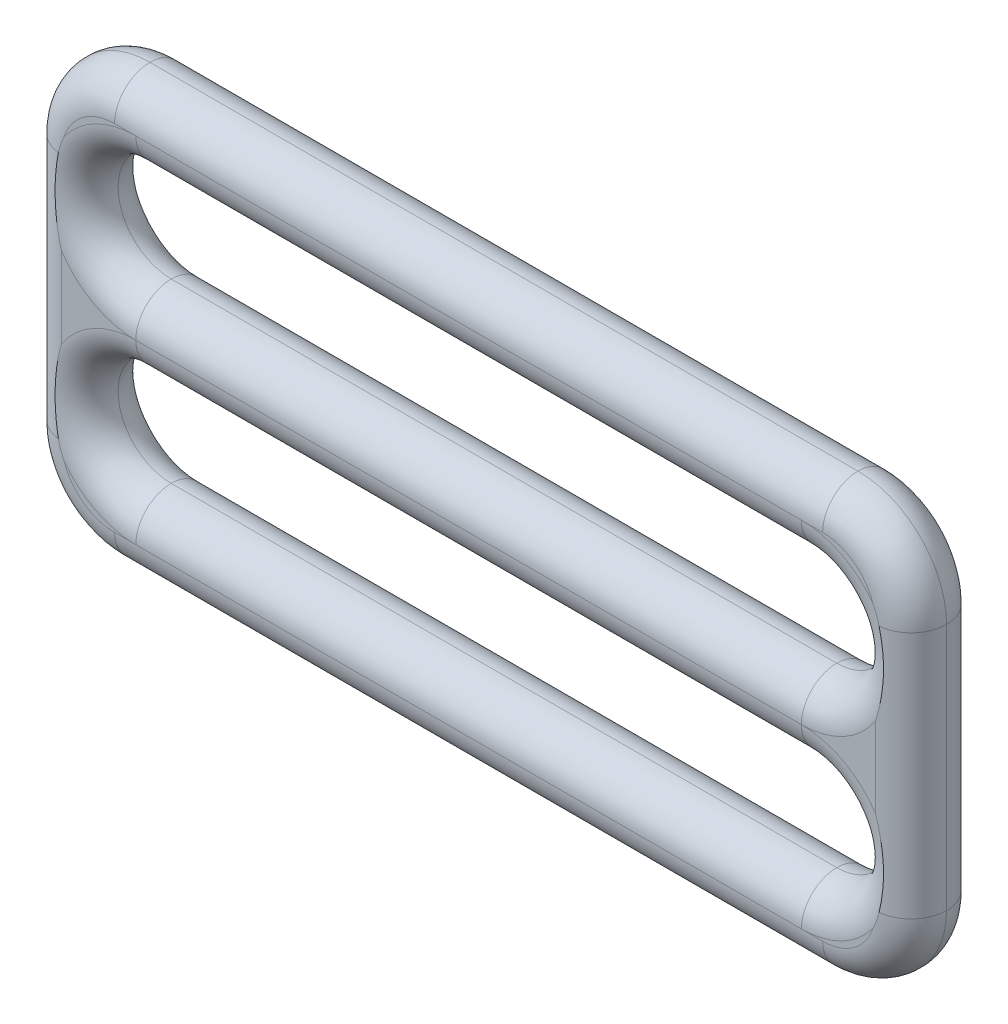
ISO-10303-21;
HEADER;
FILE_DESCRIPTION(('STEP AP214'),'2;1');
FILE_NAME('part.step','',(''),(''),'','','');
FILE_SCHEMA(('AUTOMOTIVE_DESIGN { 1 0 10303 214 1 1 1 1 }'));
ENDSEC;
DATA;
#1=APPLICATION_CONTEXT('core data for automotive mechanical design processes');
#2=APPLICATION_PROTOCOL_DEFINITION('international standard','automotive_design',2000,#1);
#3=PRODUCT_CONTEXT('',#1,'mechanical');
#4=PRODUCT('Part','Part','',(#3));
#5=PRODUCT_RELATED_PRODUCT_CATEGORY('part','',(#4));
#6=PRODUCT_DEFINITION_FORMATION('','',#4);
#7=PRODUCT_DEFINITION_CONTEXT('part definition',#1,'design');
#8=PRODUCT_DEFINITION('design','',#6,#7);
#9=PRODUCT_DEFINITION_SHAPE('','',#8);
#10=(LENGTH_UNIT() NAMED_UNIT(*) SI_UNIT(.MILLI.,.METRE.));
#11=(NAMED_UNIT(*) PLANE_ANGLE_UNIT() SI_UNIT($,.RADIAN.));
#12=(NAMED_UNIT(*) SI_UNIT($,.STERADIAN.) SOLID_ANGLE_UNIT());
#13=UNCERTAINTY_MEASURE_WITH_UNIT(LENGTH_MEASURE(1.E-05),#10,'distance_accuracy_value','');
#14=(GEOMETRIC_REPRESENTATION_CONTEXT(3) GLOBAL_UNCERTAINTY_ASSIGNED_CONTEXT((#13)) GLOBAL_UNIT_ASSIGNED_CONTEXT((#10,
#11,#12)) REPRESENTATION_CONTEXT('',''));
#15=CARTESIAN_POINT('',(0.,0.,0.));
#16=DIRECTION('',(0.,0.,1.));
#17=DIRECTION('',(1.,0.,0.));
#18=AXIS2_PLACEMENT_3D('',#15,#16,#17);
#19=CARTESIAN_POINT('',(12.7,4.445,-1.27));
#20=DIRECTION('',(0.,0.,-1.));
#21=DIRECTION('',(-1.,0.,0.));
#22=AXIS2_PLACEMENT_3D('',#19,#20,#21);
#23=PLANE('',#22);
#24=CARTESIAN_POINT('',(11.938,-3.175,-1.27));
#25=DIRECTION('',(0.,0.,-1.));
#26=DIRECTION('',(-1.,0.,0.));
#27=AXIS2_PLACEMENT_3D('',#24,#25,#26);
#28=CIRCLE('',#27,3.175);
#29=CARTESIAN_POINT('',(11.938,-6.35,-1.27));
#30=VERTEX_POINT('',#29);
#31=CARTESIAN_POINT('',(14.5114939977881,-5.03450360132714,-1.27));
#32=VERTEX_POINT('',#31);
#33=EDGE_CURVE('E251',#30,#32,#28,.F.);
#34=ORIENTED_EDGE('',*,*,#33,.T.);
#35=CARTESIAN_POINT('',(12.7,-4.445,-1.27));
#36=DIRECTION('',(0.,0.,-1.));
#37=DIRECTION('',(-1.,0.,0.));
#38=AXIS2_PLACEMENT_3D('',#35,#36,#37);
#39=CIRCLE('',#38,1.905);
#40=CARTESIAN_POINT('',(12.7,-6.35,-1.27));
#41=VERTEX_POINT('',#40);
#42=EDGE_CURVE('E11',#32,#41,#39,.T.);
#43=ORIENTED_EDGE('',*,*,#42,.T.);
#44=DIRECTION('',(1.,0.,0.));
#45=VECTOR('',#44,1.);
#46=CARTESIAN_POINT('',(-12.7,-6.35,-1.27));
#47=LINE('',#46,#45);
#48=EDGE_CURVE('E50',#41,#30,#47,.F.);
#49=ORIENTED_EDGE('',*,*,#48,.T.);
#50=EDGE_LOOP('',(#34,#43,#49));
#51=FACE_BOUND('',#50,.T.);
#52=ADVANCED_FACE('F35',(#51),#23,.T.);
#53=CARTESIAN_POINT('',(11.938,3.175,-1.27));
#54=DIRECTION('',(0.,0.,-1.));
#55=DIRECTION('',(-1.,0.,0.));
#56=AXIS2_PLACEMENT_3D('',#53,#54,#55);
#57=CIRCLE('',#56,3.175);
#58=CARTESIAN_POINT('',(11.938,0.,-1.27));
#59=VERTEX_POINT('',#58);
#60=CARTESIAN_POINT('',(14.605,1.45228818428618,-1.27));
#61=VERTEX_POINT('',#60);
#62=EDGE_CURVE('E674',#59,#61,#57,.F.);
#63=ORIENTED_EDGE('',*,*,#62,.T.);
#64=DIRECTION('',(0.,1.,0.));
#65=VECTOR('',#64,1.);
#66=CARTESIAN_POINT('',(14.605,-4.445,-1.27));
#67=LINE('',#66,#65);
#68=CARTESIAN_POINT('',(14.605,-1.45228818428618,-1.27));
#69=VERTEX_POINT('',#68);
#70=EDGE_CURVE('E280',#61,#69,#67,.F.);
#71=ORIENTED_EDGE('',*,*,#70,.T.);
#72=CARTESIAN_POINT('',(11.938,-3.175,-1.27));
#73=DIRECTION('',(0.,0.,-1.));
#74=DIRECTION('',(-1.,0.,0.));
#75=AXIS2_PLACEMENT_3D('',#72,#73,#74);
#76=CIRCLE('',#75,3.175);
#77=EDGE_CURVE('E283',#69,#59,#76,.F.);
#78=ORIENTED_EDGE('',*,*,#77,.T.);
#79=EDGE_LOOP('',(#63,#71,#78));
#80=FACE_BOUND('',#79,.T.);
#81=ADVANCED_FACE('F677',(#80),#23,.T.);
#82=CARTESIAN_POINT('',(-11.938,3.175,-1.27));
#83=DIRECTION('',(0.,0.,-1.));
#84=DIRECTION('',(-1.,0.,0.));
#85=AXIS2_PLACEMENT_3D('',#82,#83,#84);
#86=CIRCLE('',#85,3.175);
#87=CARTESIAN_POINT('',(-11.938,6.35,-1.27));
#88=VERTEX_POINT('',#87);
#89=CARTESIAN_POINT('',(-14.5114939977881,5.03450360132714,-1.27));
#90=VERTEX_POINT('',#89);
#91=EDGE_CURVE('E669',#88,#90,#86,.F.);
#92=ORIENTED_EDGE('',*,*,#91,.T.);
#93=CARTESIAN_POINT('',(-12.7,4.445,-1.27));
#94=DIRECTION('',(0.,0.,-1.));
#95=DIRECTION('',(-1.,0.,0.));
#96=AXIS2_PLACEMENT_3D('',#93,#94,#95);
#97=CIRCLE('',#96,1.905);
#98=CARTESIAN_POINT('',(-12.7,6.35,-1.27));
#99=VERTEX_POINT('',#98);
#100=EDGE_CURVE('E671',#90,#99,#97,.T.);
#101=ORIENTED_EDGE('',*,*,#100,.T.);
#102=DIRECTION('',(-1.,0.,0.));
#103=VECTOR('',#102,1.);
#104=CARTESIAN_POINT('',(12.7,6.35,-1.27));
#105=LINE('',#104,#103);
#106=EDGE_CURVE('E667',#99,#88,#105,.F.);
#107=ORIENTED_EDGE('',*,*,#106,.T.);
#108=EDGE_LOOP('',(#92,#101,#107));
#109=FACE_BOUND('',#108,.T.);
#110=ADVANCED_FACE('F814',(#109),#23,.T.);
#111=DIRECTION('',(-1.,0.,0.));
#112=VECTOR('',#111,1.);
#113=CARTESIAN_POINT('',(12.7,6.35,-1.27));
#114=LINE('',#113,#112);
#115=CARTESIAN_POINT('',(11.938,6.35,-1.27));
#116=VERTEX_POINT('',#115);
#117=CARTESIAN_POINT('',(12.7,6.35,-1.27));
#118=VERTEX_POINT('',#117);
#119=EDGE_CURVE('E660',#116,#118,#114,.F.);
#120=ORIENTED_EDGE('',*,*,#119,.T.);
#121=CARTESIAN_POINT('',(12.7,4.445,-1.27));
#122=DIRECTION('',(0.,0.,-1.));
#123=DIRECTION('',(-1.,0.,0.));
#124=AXIS2_PLACEMENT_3D('',#121,#122,#123);
#125=CIRCLE('',#124,1.905);
#126=CARTESIAN_POINT('',(14.5114939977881,5.03450360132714,-1.27));
#127=VERTEX_POINT('',#126);
#128=EDGE_CURVE('E664',#118,#127,#125,.T.);
#129=ORIENTED_EDGE('',*,*,#128,.T.);
#130=CARTESIAN_POINT('',(11.938,3.175,-1.27));
#131=DIRECTION('',(0.,0.,-1.));
#132=DIRECTION('',(-1.,0.,0.));
#133=AXIS2_PLACEMENT_3D('',#130,#131,#132);
#134=CIRCLE('',#133,3.175);
#135=EDGE_CURVE('E662',#127,#116,#134,.F.);
#136=ORIENTED_EDGE('',*,*,#135,.T.);
#137=EDGE_LOOP('',(#120,#129,#136));
#138=FACE_BOUND('',#137,.T.);
#139=ADVANCED_FACE('F752',(#138),#23,.T.);
#140=CARTESIAN_POINT('',(-11.938,-3.175,-1.27));
#141=DIRECTION('',(0.,0.,-1.));
#142=DIRECTION('',(-1.,0.,0.));
#143=AXIS2_PLACEMENT_3D('',#140,#141,#142);
#144=CIRCLE('',#143,3.175);
#145=CARTESIAN_POINT('',(-11.938,0.,-1.27));
#146=VERTEX_POINT('',#145);
#147=CARTESIAN_POINT('',(-14.605,-1.45228818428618,-1.27));
#148=VERTEX_POINT('',#147);
#149=EDGE_CURVE('E653',#146,#148,#144,.F.);
#150=ORIENTED_EDGE('',*,*,#149,.T.);
#151=DIRECTION('',(0.,-1.,0.));
#152=VECTOR('',#151,1.);
#153=CARTESIAN_POINT('',(-14.605,4.445,-1.27));
#154=LINE('',#153,#152);
#155=CARTESIAN_POINT('',(-14.605,1.45228818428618,-1.27));
#156=VERTEX_POINT('',#155);
#157=EDGE_CURVE('E657',#148,#156,#154,.F.);
#158=ORIENTED_EDGE('',*,*,#157,.T.);
#159=CARTESIAN_POINT('',(-11.938,3.175,-1.27));
#160=DIRECTION('',(0.,0.,-1.));
#161=DIRECTION('',(-1.,0.,0.));
#162=AXIS2_PLACEMENT_3D('',#159,#160,#161);
#163=CIRCLE('',#162,3.175);
#164=EDGE_CURVE('E655',#156,#146,#163,.F.);
#165=ORIENTED_EDGE('',*,*,#164,.T.);
#166=EDGE_LOOP('',(#150,#158,#165));
#167=FACE_BOUND('',#166,.T.);
#168=ADVANCED_FACE('F728',(#167),#23,.T.);
#169=CARTESIAN_POINT('',(12.7,4.445,1.27));
#170=DIRECTION('',(0.,0.,-1.));
#171=DIRECTION('',(-1.,0.,0.));
#172=AXIS2_PLACEMENT_3D('',#169,#170,#171);
#173=PLANE('',#172);
#174=DIRECTION('',(1.,0.,0.));
#175=VECTOR('',#174,1.);
#176=CARTESIAN_POINT('',(12.7,-6.35,1.27));
#177=LINE('',#176,#175);
#178=CARTESIAN_POINT('',(11.938,-6.35,1.27));
#179=VERTEX_POINT('',#178);
#180=CARTESIAN_POINT('',(12.7,-6.35,1.27));
#181=VERTEX_POINT('',#180);
#182=EDGE_CURVE('E643',#179,#181,#177,.T.);
#183=ORIENTED_EDGE('',*,*,#182,.T.);
#184=CARTESIAN_POINT('',(12.7,-4.445,1.27));
#185=DIRECTION('',(0.,0.,-1.));
#186=DIRECTION('',(-1.,0.,0.));
#187=AXIS2_PLACEMENT_3D('',#184,#185,#186);
#188=CIRCLE('',#187,1.905);
#189=CARTESIAN_POINT('',(14.5114939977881,-5.03450360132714,1.27));
#190=VERTEX_POINT('',#189);
#191=EDGE_CURVE('E645',#181,#190,#188,.F.);
#192=ORIENTED_EDGE('',*,*,#191,.T.);
#193=CARTESIAN_POINT('',(11.938,-3.175,1.27));
#194=DIRECTION('',(0.,0.,-1.));
#195=DIRECTION('',(-1.,0.,0.));
#196=AXIS2_PLACEMENT_3D('',#193,#194,#195);
#197=CIRCLE('',#196,3.175);
#198=EDGE_CURVE('E641',#190,#179,#197,.T.);
#199=ORIENTED_EDGE('',*,*,#198,.T.);
#200=EDGE_LOOP('',(#183,#192,#199));
#201=FACE_BOUND('',#200,.T.);
#202=ADVANCED_FACE('F799',(#201),#173,.F.);
#203=CARTESIAN_POINT('',(11.938,-3.175,1.27));
#204=DIRECTION('',(0.,0.,-1.));
#205=DIRECTION('',(-1.,0.,0.));
#206=AXIS2_PLACEMENT_3D('',#203,#204,#205);
#207=CIRCLE('',#206,3.175);
#208=CARTESIAN_POINT('',(11.938,0.,1.27));
#209=VERTEX_POINT('',#208);
#210=CARTESIAN_POINT('',(14.605,-1.45228818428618,1.27));
#211=VERTEX_POINT('',#210);
#212=EDGE_CURVE('E636',#209,#211,#207,.T.);
#213=ORIENTED_EDGE('',*,*,#212,.T.);
#214=DIRECTION('',(0.,1.,0.));
#215=VECTOR('',#214,1.);
#216=CARTESIAN_POINT('',(14.605,4.445,1.27));
#217=LINE('',#216,#215);
#218=CARTESIAN_POINT('',(14.605,1.45228818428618,1.27));
#219=VERTEX_POINT('',#218);
#220=EDGE_CURVE('E638',#211,#219,#217,.T.);
#221=ORIENTED_EDGE('',*,*,#220,.T.);
#222=CARTESIAN_POINT('',(11.938,3.175,1.27));
#223=DIRECTION('',(0.,0.,-1.));
#224=DIRECTION('',(-1.,0.,0.));
#225=AXIS2_PLACEMENT_3D('',#222,#223,#224);
#226=CIRCLE('',#225,3.175);
#227=EDGE_CURVE('E634',#219,#209,#226,.T.);
#228=ORIENTED_EDGE('',*,*,#227,.T.);
#229=EDGE_LOOP('',(#213,#221,#228));
#230=FACE_BOUND('',#229,.T.);
#231=ADVANCED_FACE('F795',(#230),#173,.F.);
#232=CARTESIAN_POINT('',(11.938,3.175,1.27));
#233=DIRECTION('',(0.,0.,-1.));
#234=DIRECTION('',(-1.,0.,0.));
#235=AXIS2_PLACEMENT_3D('',#232,#233,#234);
#236=CIRCLE('',#235,3.175);
#237=CARTESIAN_POINT('',(11.938,6.35,1.27));
#238=VERTEX_POINT('',#237);
#239=CARTESIAN_POINT('',(14.5114939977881,5.03450360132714,1.27));
#240=VERTEX_POINT('',#239);
#241=EDGE_CURVE('E629',#238,#240,#236,.T.);
#242=ORIENTED_EDGE('',*,*,#241,.T.);
#243=CARTESIAN_POINT('',(12.7,4.445,1.27));
#244=DIRECTION('',(0.,0.,-1.));
#245=DIRECTION('',(-1.,0.,0.));
#246=AXIS2_PLACEMENT_3D('',#243,#244,#245);
#247=CIRCLE('',#246,1.905);
#248=CARTESIAN_POINT('',(12.7,6.35,1.27));
#249=VERTEX_POINT('',#248);
#250=EDGE_CURVE('E631',#240,#249,#247,.F.);
#251=ORIENTED_EDGE('',*,*,#250,.T.);
#252=DIRECTION('',(-1.,0.,0.));
#253=VECTOR('',#252,1.);
#254=CARTESIAN_POINT('',(12.7,6.35,1.27));
#255=LINE('',#254,#253);
#256=EDGE_CURVE('E627',#249,#238,#255,.T.);
#257=ORIENTED_EDGE('',*,*,#256,.T.);
#258=EDGE_LOOP('',(#242,#251,#257));
#259=FACE_BOUND('',#258,.T.);
#260=ADVANCED_FACE('F793',(#259),#173,.F.);
#261=CARTESIAN_POINT('',(-12.7,-4.445,1.27));
#262=DIRECTION('',(0.,0.,-1.));
#263=DIRECTION('',(-1.,0.,0.));
#264=AXIS2_PLACEMENT_3D('',#261,#262,#263);
#265=CIRCLE('',#264,1.905);
#266=CARTESIAN_POINT('',(-14.5114939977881,-5.03450360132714,1.27));
#267=VERTEX_POINT('',#266);
#268=CARTESIAN_POINT('',(-12.7,-6.35,1.27));
#269=VERTEX_POINT('',#268);
#270=EDGE_CURVE('E622',#267,#269,#265,.F.);
#271=ORIENTED_EDGE('',*,*,#270,.T.);
#272=DIRECTION('',(1.,0.,0.));
#273=VECTOR('',#272,1.);
#274=CARTESIAN_POINT('',(12.7,-6.35,1.27));
#275=LINE('',#274,#273);
#276=CARTESIAN_POINT('',(-11.938,-6.35,1.27));
#277=VERTEX_POINT('',#276);
#278=EDGE_CURVE('E624',#269,#277,#275,.T.);
#279=ORIENTED_EDGE('',*,*,#278,.T.);
#280=CARTESIAN_POINT('',(-11.938,-3.175,1.27));
#281=DIRECTION('',(0.,0.,-1.));
#282=DIRECTION('',(-1.,0.,0.));
#283=AXIS2_PLACEMENT_3D('',#280,#281,#282);
#284=CIRCLE('',#283,3.175);
#285=EDGE_CURVE('E620',#277,#267,#284,.T.);
#286=ORIENTED_EDGE('',*,*,#285,.T.);
#287=EDGE_LOOP('',(#271,#279,#286));
#288=FACE_BOUND('',#287,.T.);
#289=ADVANCED_FACE('F863',(#288),#173,.F.);
#290=CARTESIAN_POINT('',(-11.938,3.175,1.27));
#291=DIRECTION('',(0.,0.,-1.));
#292=DIRECTION('',(-1.,0.,0.));
#293=AXIS2_PLACEMENT_3D('',#290,#291,#292);
#294=CIRCLE('',#293,3.175);
#295=CARTESIAN_POINT('',(-11.938,0.,1.27));
#296=VERTEX_POINT('',#295);
#297=CARTESIAN_POINT('',(-14.605,1.45228818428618,1.27));
#298=VERTEX_POINT('',#297);
#299=EDGE_CURVE('E613',#296,#298,#294,.T.);
#300=ORIENTED_EDGE('',*,*,#299,.T.);
#301=DIRECTION('',(0.,-1.,0.));
#302=VECTOR('',#301,1.);
#303=CARTESIAN_POINT('',(-14.605,4.445,1.27));
#304=LINE('',#303,#302);
#305=CARTESIAN_POINT('',(-14.605,-1.45228818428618,1.27));
#306=VERTEX_POINT('',#305);
#307=EDGE_CURVE('E617',#298,#306,#304,.T.);
#308=ORIENTED_EDGE('',*,*,#307,.T.);
#309=CARTESIAN_POINT('',(-11.938,-3.175,1.27));
#310=DIRECTION('',(0.,0.,-1.));
#311=DIRECTION('',(-1.,0.,0.));
#312=AXIS2_PLACEMENT_3D('',#309,#310,#311);
#313=CIRCLE('',#312,3.175);
#314=EDGE_CURVE('E615',#306,#296,#313,.T.);
#315=ORIENTED_EDGE('',*,*,#314,.T.);
#316=EDGE_LOOP('',(#300,#308,#315));
#317=FACE_BOUND('',#316,.T.);
#318=ADVANCED_FACE('F809',(#317),#173,.F.);
#319=DIRECTION('',(-1.,0.,0.));
#320=VECTOR('',#319,1.);
#321=CARTESIAN_POINT('',(12.7,6.35,1.27));
#322=LINE('',#321,#320);
#323=CARTESIAN_POINT('',(-11.938,6.35,1.27));
#324=VERTEX_POINT('',#323);
#325=CARTESIAN_POINT('',(-12.7,6.35,1.27));
#326=VERTEX_POINT('',#325);
#327=EDGE_CURVE('E604',#324,#326,#322,.T.);
#328=ORIENTED_EDGE('',*,*,#327,.T.);
#329=CARTESIAN_POINT('',(-12.7,4.445,1.27));
#330=DIRECTION('',(0.,0.,-1.));
#331=DIRECTION('',(-1.,0.,0.));
#332=AXIS2_PLACEMENT_3D('',#329,#330,#331);
#333=CIRCLE('',#332,1.905);
#334=CARTESIAN_POINT('',(-14.5114939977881,5.03450360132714,1.27));
#335=VERTEX_POINT('',#334);
#336=EDGE_CURVE('E609',#326,#335,#333,.F.);
#337=ORIENTED_EDGE('',*,*,#336,.T.);
#338=CARTESIAN_POINT('',(-11.938,3.175,1.27));
#339=DIRECTION('',(0.,0.,-1.));
#340=DIRECTION('',(-1.,0.,0.));
#341=AXIS2_PLACEMENT_3D('',#338,#339,#340);
#342=CIRCLE('',#341,3.175);
#343=EDGE_CURVE('E603',#335,#324,#342,.T.);
#344=ORIENTED_EDGE('',*,*,#343,.T.);
#345=EDGE_LOOP('',(#328,#337,#344));
#346=FACE_BOUND('',#345,.T.);
#347=ADVANCED_FACE('F802',(#346),#173,.F.);
#348=CARTESIAN_POINT('',(-11.938,-3.175,-1.27));
#349=DIRECTION('',(0.,0.,-1.));
#350=DIRECTION('',(-1.,0.,0.));
#351=AXIS2_PLACEMENT_3D('',#348,#349,#350);
#352=CIRCLE('',#351,3.175);
#353=CARTESIAN_POINT('',(-14.5114939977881,-5.03450360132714,-1.27));
#354=VERTEX_POINT('',#353);
#355=CARTESIAN_POINT('',(-11.938,-6.35,-1.27));
#356=VERTEX_POINT('',#355);
#357=EDGE_CURVE('E648',#354,#356,#352,.F.);
#358=ORIENTED_EDGE('',*,*,#357,.T.);
#359=DIRECTION('',(1.,0.,0.));
#360=VECTOR('',#359,1.);
#361=CARTESIAN_POINT('',(-12.7,-6.35,-1.27));
#362=LINE('',#361,#360);
#363=CARTESIAN_POINT('',(-12.7,-6.35,-1.27));
#364=VERTEX_POINT('',#363);
#365=EDGE_CURVE('E260',#356,#364,#362,.F.);
#366=ORIENTED_EDGE('',*,*,#365,.T.);
#367=CARTESIAN_POINT('',(-12.7,-4.445,-1.27));
#368=DIRECTION('',(0.,0.,-1.));
#369=DIRECTION('',(-1.,0.,0.));
#370=AXIS2_PLACEMENT_3D('',#367,#368,#369);
#371=CIRCLE('',#370,1.905);
#372=EDGE_CURVE('E650',#364,#354,#371,.T.);
#373=ORIENTED_EDGE('',*,*,#372,.T.);
#374=EDGE_LOOP('',(#358,#366,#373));
#375=FACE_BOUND('',#374,.T.);
#376=ADVANCED_FACE('F807',(#375),#23,.T.);
#377=CARTESIAN_POINT('',(-12.7,-4.445,0.));
#378=DIRECTION('',(0.,0.,-1.));
#379=DIRECTION('',(-1.,0.,0.));
#380=AXIS2_PLACEMENT_3D('',#377,#378,#379);
#381=TOROIDAL_SURFACE('',#380,1.905,1.27);
#382=CARTESIAN_POINT('',(-14.5114939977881,-5.03450360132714,-1.27));
#383=CARTESIAN_POINT('',(-14.5134393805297,-5.03067556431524,-1.26999999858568));
#384=CARTESIAN_POINT('',(-14.5153745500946,-5.02684210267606,-1.26999947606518));
#385=CARTESIAN_POINT('',(-14.5781744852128,-4.90160306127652,-1.26996497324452));
#386=CARTESIAN_POINT('',(-14.6288193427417,-4.77484315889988,-1.2693964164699));
#387=CARTESIAN_POINT('',(-14.7092140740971,-4.51287668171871,-1.2662843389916));
#388=CARTESIAN_POINT('',(-14.7386531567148,-4.37757488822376,-1.26371254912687));
#389=CARTESIAN_POINT('',(-14.7565209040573,-4.24105069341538,-1.25967554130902));
#390=B_SPLINE_CURVE_WITH_KNOTS('',3,(#382,#383,#384,#385,#386,#387,#388,#389),.UNSPECIFIED.,.F.,
.F.,(4,2,2,4),(0.,0.0128825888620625,0.420286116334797,0.833545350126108),.UNSPECIFIED.);
#391=CARTESIAN_POINT('',(-14.7209565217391,-4.44500000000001,-1.26469525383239));
#392=VERTEX_POINT('',#391);
#393=EDGE_CURVE('E40',#354,#392,#390,.T.);
#394=ORIENTED_EDGE('',*,*,#393,.F.);
#395=ORIENTED_EDGE('',*,*,#372,.F.);
#396=CARTESIAN_POINT('',(-12.7,-6.35,0.));
#397=DIRECTION('',(1.,0.,0.));
#398=DIRECTION('',(0.,0.,-1.));
#399=AXIS2_PLACEMENT_3D('',#396,#397,#398);
#400=CIRCLE('',#399,1.27);
#401=CARTESIAN_POINT('',(-12.7,-7.62,0.));
#402=VERTEX_POINT('',#401);
#403=EDGE_CURVE('E135',#402,#364,#400,.T.);
#404=ORIENTED_EDGE('',*,*,#403,.F.);
#405=CARTESIAN_POINT('',(-12.7,-4.445,0.));
#406=DIRECTION('',(0.,0.,-1.));
#407=DIRECTION('',(-1.,0.,0.));
#408=AXIS2_PLACEMENT_3D('',#405,#406,#407);
#409=CIRCLE('',#408,3.175);
#410=CARTESIAN_POINT('',(-15.875,-4.445,0.));
#411=VERTEX_POINT('',#410);
#412=EDGE_CURVE('E597',#411,#402,#409,.F.);
#413=ORIENTED_EDGE('',*,*,#412,.F.);
#414=CARTESIAN_POINT('',(-14.605,-4.445,0.));
#415=DIRECTION('',(0.,1.,0.));
#416=DIRECTION('',(0.,0.,1.));
#417=AXIS2_PLACEMENT_3D('',#414,#415,#416);
#418=CIRCLE('',#417,1.27);
#419=EDGE_CURVE('E720',#392,#411,#418,.T.);
#420=ORIENTED_EDGE('',*,*,#419,.F.);
#421=EDGE_LOOP('',(#394,#395,#404,#413,#420));
#422=FACE_BOUND('',#421,.T.);
#423=ADVANCED_FACE('F37',(#422),#381,.T.);
#424=CARTESIAN_POINT('',(-11.938,-3.175,0.));
#425=DIRECTION('',(0.,0.,-1.));
#426=DIRECTION('',(-1.,0.,0.));
#427=AXIS2_PLACEMENT_3D('',#424,#425,#426);
#428=TOROIDAL_SURFACE('',#427,3.175,1.27);
#429=ORIENTED_EDGE('',*,*,#357,.F.);
#430=ORIENTED_EDGE('',*,*,#393,.T.);
#431=CARTESIAN_POINT('',(-14.605,-1.45228818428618,-1.27));
#432=CARTESIAN_POINT('',(-14.6059122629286,-1.45538180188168,-1.26999998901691));
#433=CARTESIAN_POINT('',(-14.6068222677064,-1.4584761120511,-1.26999900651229));
#434=CARTESIAN_POINT('',(-14.6562342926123,-1.62694913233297,-1.26989336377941));
#435=CARTESIAN_POINT('',(-14.6982803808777,-1.79429468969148,-1.26705368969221));
#436=CARTESIAN_POINT('',(-14.7683342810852,-2.13199479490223,-1.25995025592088));
#437=CARTESIAN_POINT('',(-14.7963311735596,-2.30235157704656,-1.25568539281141));
#438=CARTESIAN_POINT('',(-14.8271943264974,-2.55937685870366,-1.25045175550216));
#439=CARTESIAN_POINT('',(-14.8356295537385,-2.64538789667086,-1.24890017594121));
#440=CARTESIAN_POINT('',(-14.8487087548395,-2.81770375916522,-1.24641607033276));
#441=CARTESIAN_POINT('',(-14.853353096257,-2.9040085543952,-1.24548348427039));
#442=CARTESIAN_POINT('',(-14.8588109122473,-3.0767009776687,-1.24438223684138));
#443=CARTESIAN_POINT('',(-14.8596262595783,-3.16308854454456,-1.24421320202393));
#444=CARTESIAN_POINT('',(-14.8574250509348,-3.33580396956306,-1.24466183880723));
#445=CARTESIAN_POINT('',(-14.8544089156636,-3.42213183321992,-1.2452794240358));
#446=CARTESIAN_POINT('',(-14.8449892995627,-3.58721653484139,-1.24712697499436));
#447=CARTESIAN_POINT('',(-14.8388962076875,-3.66599196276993,-1.24830030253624));
#448=CARTESIAN_POINT('',(-14.823566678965,-3.82321445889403,-1.2510750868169));
#449=CARTESIAN_POINT('',(-14.814330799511,-3.9016615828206,-1.25267646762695));
#450=CARTESIAN_POINT('',(-14.7927993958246,-4.05793639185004,-1.25608569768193));
#451=CARTESIAN_POINT('',(-14.7805112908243,-4.13576511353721,-1.25789304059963));
#452=CARTESIAN_POINT('',(-14.7529396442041,-4.29090109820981,-1.26142819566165));
#453=CARTESIAN_POINT('',(-14.7376557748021,-4.3682083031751,-1.26315599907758));
#454=CARTESIAN_POINT('',(-14.7209130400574,-4.44520000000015,-1.264699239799));
#455=B_SPLINE_CURVE_WITH_KNOTS('',3,(#431,#432,#433,#434,#435,#436,#437,#438,#439,#440,#441,
#442,#443,#444,#445,#446,#447,#448,#449,#450,#451,#452,#453,#454),.UNSPECIFIED.,.F.,.F.,(4,2,2,
2,2,2,2,2,2,2,2,4),(0.,0.00967603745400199,0.526704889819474,1.04413497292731,1.30337400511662,
1.56258789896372,1.82167499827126,2.08073365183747,2.31772762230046,2.55467958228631,
2.79106111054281,3.02746851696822),.UNSPECIFIED.);
#456=EDGE_CURVE('E568',#148,#392,#455,.T.);
#457=ORIENTED_EDGE('',*,*,#456,.F.);
#458=ORIENTED_EDGE('',*,*,#149,.F.);
#459=CARTESIAN_POINT('',(-11.938,0.,0.));
#460=DIRECTION('',(1.,0.,0.));
#461=DIRECTION('',(0.,0.,-1.));
#462=AXIS2_PLACEMENT_3D('',#459,#460,#461);
#463=CIRCLE('',#462,1.27);
#464=CARTESIAN_POINT('',(-11.938,-1.27,0.));
#465=VERTEX_POINT('',#464);
#466=EDGE_CURVE('E264',#465,#146,#463,.T.);
#467=ORIENTED_EDGE('',*,*,#466,.F.);
#468=CARTESIAN_POINT('',(-11.938,-3.175,0.));
#469=DIRECTION('',(0.,0.,-1.));
#470=DIRECTION('',(-1.,0.,0.));
#471=AXIS2_PLACEMENT_3D('',#468,#469,#470);
#472=CIRCLE('',#471,1.905);
#473=CARTESIAN_POINT('',(-11.938,-5.08,0.));
#474=VERTEX_POINT('',#473);
#475=EDGE_CURVE('E596',#474,#465,#472,.T.);
#476=ORIENTED_EDGE('',*,*,#475,.F.);
#477=CARTESIAN_POINT('',(-11.938,-6.35,0.));
#478=DIRECTION('',(1.,0.,0.));
#479=DIRECTION('',(0.,0.,-1.));
#480=AXIS2_PLACEMENT_3D('',#477,#478,#479);
#481=CIRCLE('',#480,1.27);
#482=EDGE_CURVE('E263',#356,#474,#481,.T.);
#483=ORIENTED_EDGE('',*,*,#482,.F.);
#484=EDGE_LOOP('',(#429,#430,#457,#458,#467,#476,#483));
#485=FACE_BOUND('',#484,.T.);
#486=ADVANCED_FACE('F580',(#485),#428,.T.);
#487=CARTESIAN_POINT('',(-12.7,-6.35,0.));
#488=DIRECTION('',(-1.,0.,0.));
#489=DIRECTION('',(0.,0.,1.));
#490=AXIS2_PLACEMENT_3D('',#487,#488,#489);
#491=CYLINDRICAL_SURFACE('',#490,1.27);
#492=ORIENTED_EDGE('',*,*,#403,.T.);
#493=ORIENTED_EDGE('',*,*,#365,.F.);
#494=DIRECTION('',(1.,0.,0.));
#495=VECTOR('',#494,1.);
#496=CARTESIAN_POINT('',(-12.7,-6.35,-1.27));
#497=LINE('',#496,#495);
#498=EDGE_CURVE('E256',#30,#356,#497,.F.);
#499=ORIENTED_EDGE('',*,*,#498,.F.);
#500=ORIENTED_EDGE('',*,*,#48,.F.);
#501=CARTESIAN_POINT('',(12.7,-6.35,0.));
#502=DIRECTION('',(1.,0.,0.));
#503=DIRECTION('',(0.,0.,-1.));
#504=AXIS2_PLACEMENT_3D('',#501,#502,#503);
#505=CIRCLE('',#504,1.27);
#506=CARTESIAN_POINT('',(12.7,-7.62,0.));
#507=VERTEX_POINT('',#506);
#508=EDGE_CURVE('E59',#507,#41,#505,.T.);
#509=ORIENTED_EDGE('',*,*,#508,.F.);
#510=DIRECTION('',(1.,0.,0.));
#511=VECTOR('',#510,1.);
#512=CARTESIAN_POINT('',(12.7,-7.62,0.));
#513=LINE('',#512,#511);
#514=EDGE_CURVE('E556',#402,#507,#513,.T.);
#515=ORIENTED_EDGE('',*,*,#514,.F.);
#516=EDGE_LOOP('',(#492,#493,#499,#500,#509,#515));
#517=FACE_BOUND('',#516,.T.);
#518=ADVANCED_FACE('F258',(#517),#491,.T.);
#519=CARTESIAN_POINT('',(12.7,-6.35,0.));
#520=DIRECTION('',(1.,0.,0.));
#521=DIRECTION('',(0.,0.,-1.));
#522=AXIS2_PLACEMENT_3D('',#519,#520,#521);
#523=CYLINDRICAL_SURFACE('',#522,1.27);
#524=ORIENTED_EDGE('',*,*,#498,.T.);
#525=ORIENTED_EDGE('',*,*,#482,.T.);
#526=DIRECTION('',(1.,0.,0.));
#527=VECTOR('',#526,1.);
#528=CARTESIAN_POINT('',(-11.938,-5.08,0.));
#529=LINE('',#528,#527);
#530=CARTESIAN_POINT('',(11.938,-5.08,0.));
#531=VERTEX_POINT('',#530);
#532=EDGE_CURVE('E270',#531,#474,#529,.F.);
#533=ORIENTED_EDGE('',*,*,#532,.F.);
#534=CARTESIAN_POINT('',(11.938,-6.35,0.));
#535=DIRECTION('',(1.,0.,0.));
#536=DIRECTION('',(0.,1.,0.));
#537=AXIS2_PLACEMENT_3D('',#534,#535,#536);
#538=CIRCLE('',#537,1.27);
#539=EDGE_CURVE('E267',#30,#531,#538,.T.);
#540=ORIENTED_EDGE('',*,*,#539,.F.);
#541=EDGE_LOOP('',(#524,#525,#533,#540));
#542=FACE_BOUND('',#541,.T.);
#543=ADVANCED_FACE('F268',(#542),#523,.T.);
#544=CARTESIAN_POINT('',(12.7,0.,0.));
#545=DIRECTION('',(-1.,0.,0.));
#546=DIRECTION('',(0.,0.,1.));
#547=AXIS2_PLACEMENT_3D('',#544,#545,#546);
#548=CYLINDRICAL_SURFACE('',#547,1.27);
#549=DIRECTION('',(-1.,0.,0.));
#550=VECTOR('',#549,1.);
#551=CARTESIAN_POINT('',(-11.938,-1.27,0.));
#552=LINE('',#551,#550);
#553=CARTESIAN_POINT('',(11.938,-1.27,0.));
#554=VERTEX_POINT('',#553);
#555=EDGE_CURVE('E684',#465,#554,#552,.F.);
#556=ORIENTED_EDGE('',*,*,#555,.F.);
#557=ORIENTED_EDGE('',*,*,#466,.T.);
#558=DIRECTION('',(-1.,0.,0.));
#559=VECTOR('',#558,1.);
#560=CARTESIAN_POINT('',(12.7,0.,-1.27));
#561=LINE('',#560,#559);
#562=EDGE_CURVE('E686',#59,#146,#561,.T.);
#563=ORIENTED_EDGE('',*,*,#562,.F.);
#564=CARTESIAN_POINT('',(11.938,0.,0.));
#565=DIRECTION('',(1.,0.,0.));
#566=DIRECTION('',(0.,0.,-1.));
#567=AXIS2_PLACEMENT_3D('',#564,#565,#566);
#568=CIRCLE('',#567,1.27);
#569=EDGE_CURVE('E544',#554,#59,#568,.T.);
#570=ORIENTED_EDGE('',*,*,#569,.F.);
#571=EDGE_LOOP('',(#556,#557,#563,#570));
#572=FACE_BOUND('',#571,.T.);
#573=ADVANCED_FACE('F688',(#572),#548,.T.);
#574=CARTESIAN_POINT('',(-11.938,-3.175,0.));
#575=DIRECTION('',(0.,0.,-1.));
#576=DIRECTION('',(-1.,0.,0.));
#577=AXIS2_PLACEMENT_3D('',#574,#575,#576);
#578=TOROIDAL_SURFACE('',#577,3.175,1.27);
#579=CARTESIAN_POINT('',(-14.5114939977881,-5.03450360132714,1.27));
#580=CARTESIAN_POINT('',(-14.5134393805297,-5.03067556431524,1.26999999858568));
#581=CARTESIAN_POINT('',(-14.5153745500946,-5.02684210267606,1.26999947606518));
#582=CARTESIAN_POINT('',(-14.5781744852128,-4.90160306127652,1.26996497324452));
#583=CARTESIAN_POINT('',(-14.6288193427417,-4.77484315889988,1.2693964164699));
#584=CARTESIAN_POINT('',(-14.7092140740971,-4.51287668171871,1.2662843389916));
#585=CARTESIAN_POINT('',(-14.7386531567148,-4.37757488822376,1.26371254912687));
#586=CARTESIAN_POINT('',(-14.7565209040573,-4.24105069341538,1.25967554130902));
#587=B_SPLINE_CURVE_WITH_KNOTS('',3,(#579,#580,#581,#582,#583,#584,#585,#586),.UNSPECIFIED.,.F.,
.F.,(4,2,2,4),(0.,0.0128825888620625,0.420286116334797,0.833545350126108),.UNSPECIFIED.);
#588=CARTESIAN_POINT('',(-14.7209565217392,-4.445,1.26469525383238));
#589=VERTEX_POINT('',#588);
#590=EDGE_CURVE('E589',#267,#589,#587,.T.);
#591=ORIENTED_EDGE('',*,*,#590,.F.);
#592=ORIENTED_EDGE('',*,*,#285,.F.);
#593=CARTESIAN_POINT('',(-11.938,-6.35,0.));
#594=DIRECTION('',(1.,0.,0.));
#595=DIRECTION('',(0.,0.,-1.));
#596=AXIS2_PLACEMENT_3D('',#593,#594,#595);
#597=CIRCLE('',#596,1.27);
#598=EDGE_CURVE('E548',#474,#277,#597,.T.);
#599=ORIENTED_EDGE('',*,*,#598,.F.);
#600=ORIENTED_EDGE('',*,*,#475,.T.);
#601=CARTESIAN_POINT('',(-11.938,0.,0.));
#602=DIRECTION('',(1.,0.,0.));
#603=DIRECTION('',(0.,0.,-1.));
#604=AXIS2_PLACEMENT_3D('',#601,#602,#603);
#605=CIRCLE('',#604,1.27);
#606=EDGE_CURVE('E827',#296,#465,#605,.T.);
#607=ORIENTED_EDGE('',*,*,#606,.F.);
#608=ORIENTED_EDGE('',*,*,#314,.F.);
#609=CARTESIAN_POINT('',(-14.7209130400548,-4.44520000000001,1.26469923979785));
#610=CARTESIAN_POINT('',(-14.7387211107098,-4.36331142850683,1.26305613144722));
#611=CARTESIAN_POINT('',(-14.7548782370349,-4.2810660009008,1.2612065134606));
#612=CARTESIAN_POINT('',(-14.7838008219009,-4.11597377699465,1.25743798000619));
#613=CARTESIAN_POINT('',(-14.796565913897,-4.03312691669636,1.25551905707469));
#614=CARTESIAN_POINT('',(-14.818614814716,-3.86693138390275,1.25195548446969));
#615=CARTESIAN_POINT('',(-14.8278973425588,-3.78358253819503,1.25031093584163));
#616=CARTESIAN_POINT('',(-14.8429094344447,-3.61656566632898,1.24753956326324));
#617=CARTESIAN_POINT('',(-14.8486391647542,-3.53289765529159,1.24641271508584));
#618=CARTESIAN_POINT('',(-14.8603829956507,-3.28252764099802,1.24409225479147));
#619=CARTESIAN_POINT('',(-14.8610752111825,-3.1155331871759,1.24393456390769));
#620=CARTESIAN_POINT('',(-14.8481722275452,-2.78221704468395,1.2465176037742));
#621=CARTESIAN_POINT('',(-14.8345844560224,-2.6158950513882,1.24925682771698));
#622=CARTESIAN_POINT('',(-14.8036974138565,-2.36680812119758,1.25440034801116));
#623=CARTESIAN_POINT('',(-14.7915487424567,-2.28336027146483,1.25630146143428));
#624=CARTESIAN_POINT('',(-14.7637961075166,-2.11704345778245,1.26011204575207));
#625=CARTESIAN_POINT('',(-14.7481924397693,-2.03417444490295,1.26202151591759));
#626=CARTESIAN_POINT('',(-14.7136468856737,-1.86920285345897,1.26546279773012));
#627=CARTESIAN_POINT('',(-14.6947077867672,-1.78709969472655,1.26699492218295));
#628=CARTESIAN_POINT('',(-14.6536031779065,-1.62370085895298,1.26923654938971));
#629=CARTESIAN_POINT('',(-14.6314381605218,-1.54240506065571,1.26994617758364));
#630=CARTESIAN_POINT('',(-14.6068222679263,-1.45847612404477,1.26999901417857));
#631=CARTESIAN_POINT('',(-14.6059122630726,-1.45538181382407,1.26999999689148));
#632=CARTESIAN_POINT('',(-14.605,-1.45228818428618,1.27));
#633=B_SPLINE_CURVE_WITH_KNOTS('',3,(#609,#610,#611,#612,#613,#614,#615,#616,#617,#618,#619,
#620,#621,#622,#623,#624,#625,#626,#627,#628,#629,#630,#631,#632),.UNSPECIFIED.,.F.,.F.,(4,2,2,
2,2,2,2,2,2,2,2,4),(0.,0.251441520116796,0.502910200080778,0.754471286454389,1.00602059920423,
1.50632389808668,2.00636709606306,2.25935355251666,2.51231835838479,2.76507275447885,
3.01778859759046,3.02746463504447),.UNSPECIFIED.);
#634=EDGE_CURVE('E501',#589,#306,#633,.T.);
#635=ORIENTED_EDGE('',*,*,#634,.F.);
#636=EDGE_LOOP('',(#591,#592,#599,#600,#607,#608,#635));
#637=FACE_BOUND('',#636,.T.);
#638=ADVANCED_FACE('F497',(#637),#578,.T.);
#639=CARTESIAN_POINT('',(-12.7,-4.445,0.));
#640=DIRECTION('',(0.,0.,-1.));
#641=DIRECTION('',(-1.,0.,0.));
#642=AXIS2_PLACEMENT_3D('',#639,#640,#641);
#643=TOROIDAL_SURFACE('',#642,1.905,1.27);
#644=ORIENTED_EDGE('',*,*,#270,.F.);
#645=ORIENTED_EDGE('',*,*,#590,.T.);
#646=CARTESIAN_POINT('',(-14.605,-4.445,0.));
#647=DIRECTION('',(0.,1.,0.));
#648=DIRECTION('',(0.,0.,1.));
#649=AXIS2_PLACEMENT_3D('',#646,#647,#648);
#650=CIRCLE('',#649,1.27);
#651=EDGE_CURVE('E509',#411,#589,#650,.T.);
#652=ORIENTED_EDGE('',*,*,#651,.F.);
#653=ORIENTED_EDGE('',*,*,#412,.T.);
#654=CARTESIAN_POINT('',(-12.7,-6.35,0.));
#655=DIRECTION('',(1.,0.,0.));
#656=DIRECTION('',(0.,0.,-1.));
#657=AXIS2_PLACEMENT_3D('',#654,#655,#656);
#658=CIRCLE('',#657,1.27);
#659=EDGE_CURVE('E553',#269,#402,#658,.T.);
#660=ORIENTED_EDGE('',*,*,#659,.F.);
#661=EDGE_LOOP('',(#644,#645,#652,#653,#660));
#662=FACE_BOUND('',#661,.T.);
#663=ADVANCED_FACE('F586',(#662),#643,.T.);
#664=CARTESIAN_POINT('',(-14.605,-4.445,0.));
#665=DIRECTION('',(0.,1.,0.));
#666=DIRECTION('',(0.,0.,1.));
#667=AXIS2_PLACEMENT_3D('',#664,#665,#666);
#668=CYLINDRICAL_SURFACE('',#667,1.27);
#669=CARTESIAN_POINT('',(-14.7209130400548,4.44520000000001,-1.26469923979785));
#670=CARTESIAN_POINT('',(-14.7387211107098,4.36331142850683,-1.26305613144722));
#671=CARTESIAN_POINT('',(-14.7548782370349,4.2810660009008,-1.2612065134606));
#672=CARTESIAN_POINT('',(-14.7838008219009,4.11597377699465,-1.25743798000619));
#673=CARTESIAN_POINT('',(-14.796565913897,4.03312691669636,-1.25551905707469));
#674=CARTESIAN_POINT('',(-14.818614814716,3.86693138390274,-1.25195548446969));
#675=CARTESIAN_POINT('',(-14.8278973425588,3.78358253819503,-1.25031093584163));
#676=CARTESIAN_POINT('',(-14.8429094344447,3.61656566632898,-1.24753956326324));
#677=CARTESIAN_POINT('',(-14.8486391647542,3.53289765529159,-1.24641271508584));
#678=CARTESIAN_POINT('',(-14.8603829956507,3.28252764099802,-1.24409225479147));
#679=CARTESIAN_POINT('',(-14.8610752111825,3.11553318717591,-1.24393456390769));
#680=CARTESIAN_POINT('',(-14.8481722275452,2.78221704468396,-1.2465176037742));
#681=CARTESIAN_POINT('',(-14.8345844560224,2.61589505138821,-1.24925682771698));
#682=CARTESIAN_POINT('',(-14.8036974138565,2.36680812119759,-1.25440034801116));
#683=CARTESIAN_POINT('',(-14.7915487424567,2.28336027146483,-1.25630146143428));
#684=CARTESIAN_POINT('',(-14.7637961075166,2.11704345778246,-1.26011204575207));
#685=CARTESIAN_POINT('',(-14.7481924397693,2.03417444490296,-1.26202151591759));
#686=CARTESIAN_POINT('',(-14.7136468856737,1.86920285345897,-1.26546279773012));
#687=CARTESIAN_POINT('',(-14.6947077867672,1.78709969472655,-1.26699492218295));
#688=CARTESIAN_POINT('',(-14.6536031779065,1.62370085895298,-1.26923654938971));
#689=CARTESIAN_POINT('',(-14.6314381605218,1.54240506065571,-1.26994617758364));
#690=CARTESIAN_POINT('',(-14.6068222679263,1.45847612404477,-1.26999901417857));
#691=CARTESIAN_POINT('',(-14.6059122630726,1.45538181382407,-1.26999999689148));
#692=CARTESIAN_POINT('',(-14.605,1.45228818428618,-1.27));
#693=B_SPLINE_CURVE_WITH_KNOTS('',3,(#669,#670,#671,#672,#673,#674,#675,#676,#677,#678,#679,
#680,#681,#682,#683,#684,#685,#686,#687,#688,#689,#690,#691,#692),.UNSPECIFIED.,.F.,.F.,(4,2,2,
2,2,2,2,2,2,2,2,4),(0.,0.251441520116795,0.502910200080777,0.754471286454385,1.00602059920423,
1.50632389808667,2.00636709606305,2.25935355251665,2.51231835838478,2.76507275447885,
3.01778859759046,3.02746463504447),.UNSPECIFIED.);
#694=CARTESIAN_POINT('',(-14.7209565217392,4.44500000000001,-1.26469525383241));
#695=VERTEX_POINT('',#694);
#696=EDGE_CURVE('E560',#156,#695,#693,.F.);
#697=ORIENTED_EDGE('',*,*,#696,.F.);
#698=ORIENTED_EDGE('',*,*,#157,.F.);
#699=ORIENTED_EDGE('',*,*,#456,.T.);
#700=ORIENTED_EDGE('',*,*,#419,.T.);
#701=DIRECTION('',(0.,-1.,0.));
#702=VECTOR('',#701,1.);
#703=CARTESIAN_POINT('',(-15.875,-4.445,0.));
#704=LINE('',#703,#702);
#705=CARTESIAN_POINT('',(-15.875,4.445,0.));
#706=VERTEX_POINT('',#705);
#707=EDGE_CURVE('E733',#706,#411,#704,.T.);
#708=ORIENTED_EDGE('',*,*,#707,.F.);
#709=CARTESIAN_POINT('',(-14.605,4.445,0.));
#710=DIRECTION('',(0.,1.,0.));
#711=DIRECTION('',(0.,0.,1.));
#712=AXIS2_PLACEMENT_3D('',#709,#710,#711);
#713=CIRCLE('',#712,1.27);
#714=EDGE_CURVE('E482',#695,#706,#713,.T.);
#715=ORIENTED_EDGE('',*,*,#714,.F.);
#716=EDGE_LOOP('',(#697,#698,#699,#700,#708,#715));
#717=FACE_BOUND('',#716,.T.);
#718=ADVANCED_FACE('F535',(#717),#668,.T.);
#719=CARTESIAN_POINT('',(12.7,-4.445,0.));
#720=DIRECTION('',(0.,0.,-1.));
#721=DIRECTION('',(-1.,0.,0.));
#722=AXIS2_PLACEMENT_3D('',#719,#720,#721);
#723=TOROIDAL_SURFACE('',#722,1.905,1.27);
#724=ORIENTED_EDGE('',*,*,#508,.T.);
#725=ORIENTED_EDGE('',*,*,#42,.F.);
#726=CARTESIAN_POINT('',(14.5114939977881,-5.03450360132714,-1.27));
#727=CARTESIAN_POINT('',(14.5134393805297,-5.03067556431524,-1.26999999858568));
#728=CARTESIAN_POINT('',(14.5153745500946,-5.02684210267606,-1.26999947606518));
#729=CARTESIAN_POINT('',(14.5781744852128,-4.90160306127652,-1.26996497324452));
#730=CARTESIAN_POINT('',(14.6288193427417,-4.77484315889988,-1.2693964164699));
#731=CARTESIAN_POINT('',(14.7092140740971,-4.51287668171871,-1.2662843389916));
#732=CARTESIAN_POINT('',(14.7386531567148,-4.37757488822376,-1.26371254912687));
#733=CARTESIAN_POINT('',(14.7565209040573,-4.24105069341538,-1.25967554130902));
#734=B_SPLINE_CURVE_WITH_KNOTS('',3,(#726,#727,#728,#729,#730,#731,#732,#733),.UNSPECIFIED.,.F.,
.F.,(4,2,2,4),(0.,0.0128825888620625,0.420286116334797,0.833545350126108),.UNSPECIFIED.);
#735=CARTESIAN_POINT('',(14.7209565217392,-4.445,-1.26469525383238));
#736=VERTEX_POINT('',#735);
#737=EDGE_CURVE('E274',#736,#32,#734,.F.);
#738=ORIENTED_EDGE('',*,*,#737,.F.);
#739=CARTESIAN_POINT('',(14.605,-4.445,0.));
#740=DIRECTION('',(0.,1.,0.));
#741=DIRECTION('',(0.,0.,1.));
#742=AXIS2_PLACEMENT_3D('',#739,#740,#741);
#743=CIRCLE('',#742,1.27);
#744=CARTESIAN_POINT('',(15.875,-4.445,0.));
#745=VERTEX_POINT('',#744);
#746=EDGE_CURVE('E470',#745,#736,#743,.T.);
#747=ORIENTED_EDGE('',*,*,#746,.F.);
#748=CARTESIAN_POINT('',(12.7,-4.445,0.));
#749=DIRECTION('',(0.,0.,-1.));
#750=DIRECTION('',(-1.,0.,0.));
#751=AXIS2_PLACEMENT_3D('',#748,#749,#750);
#752=CIRCLE('',#751,3.175);
#753=EDGE_CURVE('E703',#507,#745,#752,.F.);
#754=ORIENTED_EDGE('',*,*,#753,.F.);
#755=EDGE_LOOP('',(#724,#725,#738,#747,#754));
#756=FACE_BOUND('',#755,.T.);
#757=ADVANCED_FACE('F530',(#756),#723,.T.);
#758=CARTESIAN_POINT('',(12.7,-6.35,0.));
#759=DIRECTION('',(1.,0.,0.));
#760=DIRECTION('',(0.,0.,-1.));
#761=AXIS2_PLACEMENT_3D('',#758,#759,#760);
#762=CYLINDRICAL_SURFACE('',#761,1.27);
#763=DIRECTION('',(1.,0.,0.));
#764=VECTOR('',#763,1.);
#765=CARTESIAN_POINT('',(12.7,-6.35,1.27));
#766=LINE('',#765,#764);
#767=EDGE_CURVE('E550',#277,#179,#766,.T.);
#768=ORIENTED_EDGE('',*,*,#767,.F.);
#769=ORIENTED_EDGE('',*,*,#278,.F.);
#770=ORIENTED_EDGE('',*,*,#659,.T.);
#771=ORIENTED_EDGE('',*,*,#514,.T.);
#772=CARTESIAN_POINT('',(12.7,-6.35,0.));
#773=DIRECTION('',(1.,0.,0.));
#774=DIRECTION('',(0.,0.,-1.));
#775=AXIS2_PLACEMENT_3D('',#772,#773,#774);
#776=CIRCLE('',#775,1.27);
#777=EDGE_CURVE('E450',#181,#507,#776,.T.);
#778=ORIENTED_EDGE('',*,*,#777,.F.);
#779=ORIENTED_EDGE('',*,*,#182,.F.);
#780=EDGE_LOOP('',(#768,#769,#770,#771,#778,#779));
#781=FACE_BOUND('',#780,.T.);
#782=ADVANCED_FACE('F534',(#781),#762,.T.);
#783=CARTESIAN_POINT('',(-11.938,-6.35,0.));
#784=DIRECTION('',(-1.,0.,0.));
#785=DIRECTION('',(0.,0.,1.));
#786=AXIS2_PLACEMENT_3D('',#783,#784,#785);
#787=CYLINDRICAL_SURFACE('',#786,1.27);
#788=ORIENTED_EDGE('',*,*,#598,.T.);
#789=ORIENTED_EDGE('',*,*,#767,.T.);
#790=CARTESIAN_POINT('',(11.938,-6.35,0.));
#791=DIRECTION('',(1.,0.,0.));
#792=DIRECTION('',(0.,0.,-1.));
#793=AXIS2_PLACEMENT_3D('',#790,#791,#792);
#794=CIRCLE('',#793,1.27);
#795=EDGE_CURVE('E439',#531,#179,#794,.T.);
#796=ORIENTED_EDGE('',*,*,#795,.F.);
#797=ORIENTED_EDGE('',*,*,#532,.T.);
#798=EDGE_LOOP('',(#788,#789,#796,#797));
#799=FACE_BOUND('',#798,.T.);
#800=ADVANCED_FACE('F489',(#799),#787,.T.);
#801=CARTESIAN_POINT('',(-11.938,3.175,0.));
#802=DIRECTION('',(0.,0.,-1.));
#803=DIRECTION('',(-1.,0.,0.));
#804=AXIS2_PLACEMENT_3D('',#801,#802,#803);
#805=TOROIDAL_SURFACE('',#804,3.175,1.27);
#806=ORIENTED_EDGE('',*,*,#164,.F.);
#807=ORIENTED_EDGE('',*,*,#696,.T.);
#808=CARTESIAN_POINT('',(-14.5114939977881,5.03450360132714,-1.27));
#809=CARTESIAN_POINT('',(-14.5134393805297,5.03067556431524,-1.26999999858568));
#810=CARTESIAN_POINT('',(-14.5153745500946,5.02684210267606,-1.26999947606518));
#811=CARTESIAN_POINT('',(-14.5781744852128,4.90160306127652,-1.26996497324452));
#812=CARTESIAN_POINT('',(-14.6288193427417,4.77484315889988,-1.2693964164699));
#813=CARTESIAN_POINT('',(-14.7092140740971,4.51287668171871,-1.2662843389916));
#814=CARTESIAN_POINT('',(-14.7386531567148,4.37757488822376,-1.26371254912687));
#815=CARTESIAN_POINT('',(-14.7565209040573,4.24105069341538,-1.25967554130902));
#816=B_SPLINE_CURVE_WITH_KNOTS('',3,(#808,#809,#810,#811,#812,#813,#814,#815),.UNSPECIFIED.,.F.,
.F.,(4,2,2,4),(0.,0.0128825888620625,0.420286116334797,0.833545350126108),.UNSPECIFIED.);
#817=EDGE_CURVE('E473',#90,#695,#816,.T.);
#818=ORIENTED_EDGE('',*,*,#817,.F.);
#819=ORIENTED_EDGE('',*,*,#91,.F.);
#820=CARTESIAN_POINT('',(-11.938,6.35,0.));
#821=DIRECTION('',(1.,0.,0.));
#822=DIRECTION('',(0.,1.,0.));
#823=AXIS2_PLACEMENT_3D('',#820,#821,#822);
#824=CIRCLE('',#823,1.27);
#825=CARTESIAN_POINT('',(-11.938,5.08,0.));
#826=VERTEX_POINT('',#825);
#827=EDGE_CURVE('E469',#826,#88,#824,.T.);
#828=ORIENTED_EDGE('',*,*,#827,.F.);
#829=CARTESIAN_POINT('',(-11.938,3.175,0.));
#830=DIRECTION('',(0.,0.,-1.));
#831=DIRECTION('',(-1.,0.,0.));
#832=AXIS2_PLACEMENT_3D('',#829,#830,#831);
#833=CIRCLE('',#832,1.905);
#834=CARTESIAN_POINT('',(-11.938,1.27,0.));
#835=VERTEX_POINT('',#834);
#836=EDGE_CURVE('E515',#835,#826,#833,.T.);
#837=ORIENTED_EDGE('',*,*,#836,.F.);
#838=CARTESIAN_POINT('',(-11.938,0.,0.));
#839=DIRECTION('',(1.,0.,0.));
#840=DIRECTION('',(0.,1.,0.));
#841=AXIS2_PLACEMENT_3D('',#838,#839,#840);
#842=CIRCLE('',#841,1.27);
#843=EDGE_CURVE('E690',#146,#835,#842,.T.);
#844=ORIENTED_EDGE('',*,*,#843,.F.);
#845=EDGE_LOOP('',(#806,#807,#818,#819,#828,#837,#844));
#846=FACE_BOUND('',#845,.T.);
#847=ADVANCED_FACE('F485',(#846),#805,.T.);
#848=CARTESIAN_POINT('',(11.938,-3.175,0.));
#849=DIRECTION('',(0.,0.,-1.));
#850=DIRECTION('',(-1.,0.,0.));
#851=AXIS2_PLACEMENT_3D('',#848,#849,#850);
#852=TOROIDAL_SURFACE('',#851,3.175,1.27);
#853=ORIENTED_EDGE('',*,*,#569,.T.);
#854=ORIENTED_EDGE('',*,*,#77,.F.);
#855=CARTESIAN_POINT('',(14.7209130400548,-4.44520000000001,-1.26469923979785));
#856=CARTESIAN_POINT('',(14.7387211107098,-4.36331142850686,-1.26305613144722));
#857=CARTESIAN_POINT('',(14.7548782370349,-4.28106600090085,-1.2612065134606));
#858=CARTESIAN_POINT('',(14.7838008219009,-4.11597377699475,-1.25743798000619));
#859=CARTESIAN_POINT('',(14.796565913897,-4.03312691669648,-1.2555190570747));
#860=CARTESIAN_POINT('',(14.8186148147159,-3.86693138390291,-1.25195548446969));
#861=CARTESIAN_POINT('',(14.8278973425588,-3.78358253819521,-1.25031093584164));
#862=CARTESIAN_POINT('',(14.8429094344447,-3.61656566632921,-1.24753956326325));
#863=CARTESIAN_POINT('',(14.8486391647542,-3.53289765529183,-1.24641271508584));
#864=CARTESIAN_POINT('',(14.8603829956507,-3.28252764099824,-1.24409225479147));
#865=CARTESIAN_POINT('',(14.8610752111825,-3.11553318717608,-1.24393456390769));
#866=CARTESIAN_POINT('',(14.8481722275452,-2.78221704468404,-1.2465176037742));
#867=CARTESIAN_POINT('',(14.8345844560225,-2.61589505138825,-1.24925682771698));
#868=CARTESIAN_POINT('',(14.8036974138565,-2.36680812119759,-1.25440034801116));
#869=CARTESIAN_POINT('',(14.7915487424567,-2.28336027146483,-1.25630146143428));
#870=CARTESIAN_POINT('',(14.7637961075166,-2.11704345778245,-1.26011204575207));
#871=CARTESIAN_POINT('',(14.7481924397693,-2.03417444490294,-1.26202151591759));
#872=CARTESIAN_POINT('',(14.7136468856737,-1.86920285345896,-1.26546279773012));
#873=CARTESIAN_POINT('',(14.6947077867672,-1.78709969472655,-1.26699492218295));
#874=CARTESIAN_POINT('',(14.6536031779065,-1.62370085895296,-1.26923654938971));
#875=CARTESIAN_POINT('',(14.6314381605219,-1.54240506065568,-1.26994617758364));
#876=CARTESIAN_POINT('',(14.6068222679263,-1.45847612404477,-1.26999901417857));
#877=CARTESIAN_POINT('',(14.6059122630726,-1.45538181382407,-1.26999999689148));
#878=CARTESIAN_POINT('',(14.605,-1.45228818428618,-1.27));
#879=B_SPLINE_CURVE_WITH_KNOTS('',3,(#855,#856,#857,#858,#859,#860,#861,#862,#863,#864,#865,
#866,#867,#868,#869,#870,#871,#872,#873,#874,#875,#876,#877,#878),.UNSPECIFIED.,.F.,.F.,(4,2,2,
2,2,2,2,2,2,2,2,4),(0.,0.251441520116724,0.502910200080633,0.75447128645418,1.00602059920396,
1.50632389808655,2.00636709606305,2.25935355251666,2.5123183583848,2.76507275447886,
3.01778859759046,3.02746463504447),.UNSPECIFIED.);
#880=EDGE_CURVE('E462',#736,#69,#879,.T.);
#881=ORIENTED_EDGE('',*,*,#880,.F.);
#882=ORIENTED_EDGE('',*,*,#737,.T.);
#883=ORIENTED_EDGE('',*,*,#33,.F.);
#884=ORIENTED_EDGE('',*,*,#539,.T.);
#885=CARTESIAN_POINT('',(11.938,-3.175,0.));
#886=DIRECTION('',(0.,0.,-1.));
#887=DIRECTION('',(-1.,0.,0.));
#888=AXIS2_PLACEMENT_3D('',#885,#886,#887);
#889=CIRCLE('',#888,1.905);
#890=EDGE_CURVE('E436',#554,#531,#889,.T.);
#891=ORIENTED_EDGE('',*,*,#890,.F.);
#892=EDGE_LOOP('',(#853,#854,#881,#882,#883,#884,#891));
#893=FACE_BOUND('',#892,.T.);
#894=ADVANCED_FACE('F278',(#893),#852,.T.);
#895=CARTESIAN_POINT('',(-11.938,0.,0.));
#896=DIRECTION('',(1.,0.,0.));
#897=DIRECTION('',(0.,0.,-1.));
#898=AXIS2_PLACEMENT_3D('',#895,#896,#897);
#899=CYLINDRICAL_SURFACE('',#898,1.27);
#900=ORIENTED_EDGE('',*,*,#606,.T.);
#901=ORIENTED_EDGE('',*,*,#555,.T.);
#902=CARTESIAN_POINT('',(11.938,0.,0.));
#903=DIRECTION('',(1.,0.,0.));
#904=DIRECTION('',(0.,0.,-1.));
#905=AXIS2_PLACEMENT_3D('',#902,#903,#904);
#906=CIRCLE('',#905,1.27);
#907=EDGE_CURVE('E433',#209,#554,#906,.T.);
#908=ORIENTED_EDGE('',*,*,#907,.F.);
#909=DIRECTION('',(-1.,0.,0.));
#910=VECTOR('',#909,1.);
#911=CARTESIAN_POINT('',(11.938,0.,1.27));
#912=LINE('',#911,#910);
#913=EDGE_CURVE('E430',#296,#209,#912,.F.);
#914=ORIENTED_EDGE('',*,*,#913,.F.);
#915=EDGE_LOOP('',(#900,#901,#908,#914));
#916=FACE_BOUND('',#915,.T.);
#917=ADVANCED_FACE('F525',(#916),#899,.T.);
#918=CARTESIAN_POINT('',(12.7,0.,0.));
#919=DIRECTION('',(1.,0.,0.));
#920=DIRECTION('',(0.,0.,-1.));
#921=AXIS2_PLACEMENT_3D('',#918,#919,#920);
#922=CYLINDRICAL_SURFACE('',#921,1.27);
#923=ORIENTED_EDGE('',*,*,#562,.T.);
#924=ORIENTED_EDGE('',*,*,#843,.T.);
#925=DIRECTION('',(1.,0.,0.));
#926=VECTOR('',#925,1.);
#927=CARTESIAN_POINT('',(-11.938,1.27,0.));
#928=LINE('',#927,#926);
#929=CARTESIAN_POINT('',(11.938,1.27,0.));
#930=VERTEX_POINT('',#929);
#931=EDGE_CURVE('E424',#930,#835,#928,.F.);
#932=ORIENTED_EDGE('',*,*,#931,.F.);
#933=CARTESIAN_POINT('',(11.938,0.,0.));
#934=DIRECTION('',(1.,0.,0.));
#935=DIRECTION('',(0.,1.,0.));
#936=AXIS2_PLACEMENT_3D('',#933,#934,#935);
#937=CIRCLE('',#936,1.27);
#938=EDGE_CURVE('E420',#59,#930,#937,.T.);
#939=ORIENTED_EDGE('',*,*,#938,.F.);
#940=EDGE_LOOP('',(#923,#924,#932,#939));
#941=FACE_BOUND('',#940,.T.);
#942=ADVANCED_FACE('F522',(#941),#922,.T.);
#943=CARTESIAN_POINT('',(-11.938,3.175,0.));
#944=DIRECTION('',(0.,0.,-1.));
#945=DIRECTION('',(-1.,0.,0.));
#946=AXIS2_PLACEMENT_3D('',#943,#944,#945);
#947=TOROIDAL_SURFACE('',#946,3.175,1.27);
#948=CARTESIAN_POINT('',(-14.605,1.45228818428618,1.27));
#949=CARTESIAN_POINT('',(-14.6059122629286,1.45538180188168,1.26999998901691));
#950=CARTESIAN_POINT('',(-14.6068222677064,1.4584761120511,1.26999900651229));
#951=CARTESIAN_POINT('',(-14.6562342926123,1.626949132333,1.26989336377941));
#952=CARTESIAN_POINT('',(-14.6982803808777,1.79429468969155,1.2670536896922));
#953=CARTESIAN_POINT('',(-14.7683342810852,2.13199479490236,1.25995025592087));
#954=CARTESIAN_POINT('',(-14.7963311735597,2.30235157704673,1.2556853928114));
#955=CARTESIAN_POINT('',(-14.8271943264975,2.55937685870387,1.25045175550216));
#956=CARTESIAN_POINT('',(-14.8356295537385,2.64538789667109,1.24890017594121));
#957=CARTESIAN_POINT('',(-14.8487087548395,2.81770375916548,1.24641607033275));
#958=CARTESIAN_POINT('',(-14.853353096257,2.90400855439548,1.24548348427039));
#959=CARTESIAN_POINT('',(-14.8588109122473,3.07670097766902,1.24438223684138));
#960=CARTESIAN_POINT('',(-14.8596262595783,3.16308854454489,1.24421320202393));
#961=CARTESIAN_POINT('',(-14.8574250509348,3.33580396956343,1.24466183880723));
#962=CARTESIAN_POINT('',(-14.8544089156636,3.4221318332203,1.2452794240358));
#963=CARTESIAN_POINT('',(-14.8449892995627,3.58721653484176,1.24712697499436));
#964=CARTESIAN_POINT('',(-14.8388962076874,3.66599196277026,1.24830030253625));
#965=CARTESIAN_POINT('',(-14.823566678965,3.82321445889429,1.2510750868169));
#966=CARTESIAN_POINT('',(-14.8143307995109,3.90166158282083,1.25267646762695));
#967=CARTESIAN_POINT('',(-14.7927993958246,4.0579363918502,1.25608569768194));
#968=CARTESIAN_POINT('',(-14.7805112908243,4.13576511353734,1.25789304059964));
#969=CARTESIAN_POINT('',(-14.7529396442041,4.29090109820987,1.26142819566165));
#970=CARTESIAN_POINT('',(-14.7376557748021,4.36820830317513,1.26315599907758));
#971=CARTESIAN_POINT('',(-14.7209130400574,4.44520000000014,1.264699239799));
#972=B_SPLINE_CURVE_WITH_KNOTS('',3,(#948,#949,#950,#951,#952,#953,#954,#955,#956,#957,#958,
#959,#960,#961,#962,#963,#964,#965,#966,#967,#968,#969,#970,#971),.UNSPECIFIED.,.F.,.F.,(4,2,2,
2,2,2,2,2,2,2,2,4),(0.,0.00967603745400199,0.526704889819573,1.0441349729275,1.30337400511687,
1.56258789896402,1.82167499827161,2.08073365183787,2.31772762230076,2.55467958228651,
2.79106111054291,3.02746851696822),.UNSPECIFIED.);
#973=CARTESIAN_POINT('',(-14.7209565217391,4.445,1.26469525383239));
#974=VERTEX_POINT('',#973);
#975=EDGE_CURVE('E508',#298,#974,#972,.T.);
#976=ORIENTED_EDGE('',*,*,#975,.F.);
#977=ORIENTED_EDGE('',*,*,#299,.F.);
#978=CARTESIAN_POINT('',(-11.938,0.,0.));
#979=DIRECTION('',(1.,0.,0.));
#980=DIRECTION('',(0.,0.,-1.));
#981=AXIS2_PLACEMENT_3D('',#978,#979,#980);
#982=CIRCLE('',#981,1.27);
#983=EDGE_CURVE('E427',#835,#296,#982,.T.);
#984=ORIENTED_EDGE('',*,*,#983,.F.);
#985=ORIENTED_EDGE('',*,*,#836,.T.);
#986=CARTESIAN_POINT('',(-11.938,6.35,0.));
#987=DIRECTION('',(1.,0.,0.));
#988=DIRECTION('',(0.,0.,-1.));
#989=AXIS2_PLACEMENT_3D('',#986,#987,#988);
#990=CIRCLE('',#989,1.27);
#991=EDGE_CURVE('E389',#324,#826,#990,.T.);
#992=ORIENTED_EDGE('',*,*,#991,.F.);
#993=ORIENTED_EDGE('',*,*,#343,.F.);
#994=CARTESIAN_POINT('',(-14.5114939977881,5.03450360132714,1.27));
#995=CARTESIAN_POINT('',(-14.5134393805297,5.03067556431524,1.26999999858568));
#996=CARTESIAN_POINT('',(-14.5153745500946,5.02684210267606,1.26999947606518));
#997=CARTESIAN_POINT('',(-14.5781744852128,4.90160306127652,1.26996497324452));
#998=CARTESIAN_POINT('',(-14.6288193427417,4.77484315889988,1.2693964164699));
#999=CARTESIAN_POINT('',(-14.7092140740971,4.51287668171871,1.2662843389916));
#1000=CARTESIAN_POINT('',(-14.7386531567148,4.37757488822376,1.26371254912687));
#1001=CARTESIAN_POINT('',(-14.7565209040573,4.24105069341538,1.25967554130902));
#1002=B_SPLINE_CURVE_WITH_KNOTS('',3,(#994,#995,#996,#997,#998,#999,#1000,#1001),.UNSPECIFIED.,
.F.,.F.,(4,2,2,4),(0.,0.0128825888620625,0.420286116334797,0.833545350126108),.UNSPECIFIED.);
#1003=EDGE_CURVE('E151',#974,#335,#1002,.F.);
#1004=ORIENTED_EDGE('',*,*,#1003,.F.);
#1005=EDGE_LOOP('',(#976,#977,#984,#985,#992,#993,#1004));
#1006=FACE_BOUND('',#1005,.T.);
#1007=ADVANCED_FACE('F391',(#1006),#947,.T.);
#1008=CARTESIAN_POINT('',(-14.605,4.445,0.));
#1009=DIRECTION('',(0.,-1.,0.));
#1010=DIRECTION('',(0.,0.,-1.));
#1011=AXIS2_PLACEMENT_3D('',#1008,#1009,#1010);
#1012=CYLINDRICAL_SURFACE('',#1011,1.27);
#1013=ORIENTED_EDGE('',*,*,#307,.F.);
#1014=ORIENTED_EDGE('',*,*,#975,.T.);
#1015=CARTESIAN_POINT('',(-14.605,4.445,0.));
#1016=DIRECTION('',(0.,1.,0.));
#1017=DIRECTION('',(0.,0.,1.));
#1018=AXIS2_PLACEMENT_3D('',#1015,#1016,#1017);
#1019=CIRCLE('',#1018,1.27);
#1020=EDGE_CURVE('E380',#706,#974,#1019,.T.);
#1021=ORIENTED_EDGE('',*,*,#1020,.F.);
#1022=ORIENTED_EDGE('',*,*,#707,.T.);
#1023=ORIENTED_EDGE('',*,*,#651,.T.);
#1024=ORIENTED_EDGE('',*,*,#634,.T.);
#1025=EDGE_LOOP('',(#1013,#1014,#1021,#1022,#1023,#1024));
#1026=FACE_BOUND('',#1025,.T.);
#1027=ADVANCED_FACE('F493',(#1026),#1012,.T.);
#1028=CARTESIAN_POINT('',(-12.7,4.445,0.));
#1029=DIRECTION('',(0.,0.,-1.));
#1030=DIRECTION('',(-1.,0.,0.));
#1031=AXIS2_PLACEMENT_3D('',#1028,#1029,#1030);
#1032=TOROIDAL_SURFACE('',#1031,1.905,1.27);
#1033=ORIENTED_EDGE('',*,*,#817,.T.);
#1034=ORIENTED_EDGE('',*,*,#714,.T.);
#1035=CARTESIAN_POINT('',(-12.7,4.445,0.));
#1036=DIRECTION('',(0.,0.,-1.));
#1037=DIRECTION('',(-1.,0.,0.));
#1038=AXIS2_PLACEMENT_3D('',#1035,#1036,#1037);
#1039=CIRCLE('',#1038,3.175);
#1040=CARTESIAN_POINT('',(-12.7,7.62,0.));
#1041=VERTEX_POINT('',#1040);
#1042=EDGE_CURVE('E377',#1041,#706,#1039,.F.);
#1043=ORIENTED_EDGE('',*,*,#1042,.F.);
#1044=CARTESIAN_POINT('',(-12.7,6.35,0.));
#1045=DIRECTION('',(1.,0.,0.));
#1046=DIRECTION('',(0.,0.,-1.));
#1047=AXIS2_PLACEMENT_3D('',#1044,#1045,#1046);
#1048=CIRCLE('',#1047,1.27);
#1049=EDGE_CURVE('E374',#99,#1041,#1048,.T.);
#1050=ORIENTED_EDGE('',*,*,#1049,.F.);
#1051=ORIENTED_EDGE('',*,*,#100,.F.);
#1052=EDGE_LOOP('',(#1033,#1034,#1043,#1050,#1051));
#1053=FACE_BOUND('',#1052,.T.);
#1054=ADVANCED_FACE('F407',(#1053),#1032,.T.);
#1055=CARTESIAN_POINT('',(14.605,-4.445,0.));
#1056=DIRECTION('',(0.,-1.,0.));
#1057=DIRECTION('',(0.,0.,-1.));
#1058=AXIS2_PLACEMENT_3D('',#1055,#1056,#1057);
#1059=CYLINDRICAL_SURFACE('',#1058,1.27);
#1060=ORIENTED_EDGE('',*,*,#880,.T.);
#1061=ORIENTED_EDGE('',*,*,#70,.F.);
#1062=CARTESIAN_POINT('',(14.605,1.45228818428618,-1.27));
#1063=CARTESIAN_POINT('',(14.6059122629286,1.45538180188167,-1.26999998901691));
#1064=CARTESIAN_POINT('',(14.6068222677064,1.45847611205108,-1.26999900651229));
#1065=CARTESIAN_POINT('',(14.6562342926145,1.62694913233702,-1.2698933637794));
#1066=CARTESIAN_POINT('',(14.6982803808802,1.79429468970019,-1.26705368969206));
#1067=CARTESIAN_POINT('',(14.7683342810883,2.13199479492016,-1.25995025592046));
#1068=CARTESIAN_POINT('',(14.7963311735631,2.30235157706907,-1.25568539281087));
#1069=CARTESIAN_POINT('',(14.8271943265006,2.55937685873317,-1.2504517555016));
#1070=CARTESIAN_POINT('',(14.8356295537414,2.64538789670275,-1.24890017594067));
#1071=CARTESIAN_POINT('',(14.8487087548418,2.81770375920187,-1.24641607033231));
#1072=CARTESIAN_POINT('',(14.8533530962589,2.90400855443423,-1.24548348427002));
#1073=CARTESIAN_POINT('',(14.8588109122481,3.07670097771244,-1.24438223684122));
#1074=CARTESIAN_POINT('',(14.8596262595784,3.16308854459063,-1.2442132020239));
#1075=CARTESIAN_POINT('',(14.8574250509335,3.33580396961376,-1.24466183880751));
#1076=CARTESIAN_POINT('',(14.8544089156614,3.42213183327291,-1.24527942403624));
#1077=CARTESIAN_POINT('',(14.8449892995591,3.58721653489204,-1.24712697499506));
#1078=CARTESIAN_POINT('',(14.8388962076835,3.66599196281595,-1.24830030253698));
#1079=CARTESIAN_POINT('',(14.8235666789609,3.82321445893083,-1.25107508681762));
#1080=CARTESIAN_POINT('',(14.8143307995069,3.9016615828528,-1.25267646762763));
#1081=CARTESIAN_POINT('',(14.7927993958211,4.05793639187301,-1.25608569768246));
#1082=CARTESIAN_POINT('',(14.7805112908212,4.13576511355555,-1.25789304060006));
#1083=CARTESIAN_POINT('',(14.7529396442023,4.29090109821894,-1.26142819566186));
#1084=CARTESIAN_POINT('',(14.7376557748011,4.36820830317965,-1.26315599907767));
#1085=CARTESIAN_POINT('',(14.7209130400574,4.44520000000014,-1.264699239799));
#1086=B_SPLINE_CURVE_WITH_KNOTS('',3,(#1062,#1063,#1064,#1065,#1066,#1067,#1068,#1069,#1070,
#1071,#1072,#1073,#1074,#1075,#1076,#1077,#1078,#1079,#1080,#1081,#1082,#1083,#1084,#1085),
.UNSPECIFIED.,.F.,.F.,(4,2,2,2,2,2,2,2,2,2,2,4),(0.,0.00967603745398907,0.526704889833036,
1.04413497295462,1.30337400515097,1.56258789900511,1.82167499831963,2.08073365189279,
2.31772762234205,2.55467958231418,2.79106111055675,3.0274685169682),.UNSPECIFIED.);
#1087=CARTESIAN_POINT('',(14.7209565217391,4.445,-1.26469525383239));
#1088=VERTEX_POINT('',#1087);
#1089=EDGE_CURVE('E412',#1088,#61,#1086,.F.);
#1090=ORIENTED_EDGE('',*,*,#1089,.F.);
#1091=CARTESIAN_POINT('',(14.605,4.445,0.));
#1092=DIRECTION('',(0.,1.,0.));
#1093=DIRECTION('',(0.,0.,1.));
#1094=AXIS2_PLACEMENT_3D('',#1091,#1092,#1093);
#1095=CIRCLE('',#1094,1.27);
#1096=CARTESIAN_POINT('',(15.875,4.445,0.));
#1097=VERTEX_POINT('',#1096);
#1098=EDGE_CURVE('E369',#1097,#1088,#1095,.T.);
#1099=ORIENTED_EDGE('',*,*,#1098,.F.);
#1100=DIRECTION('',(0.,1.,0.));
#1101=VECTOR('',#1100,1.);
#1102=CARTESIAN_POINT('',(15.875,4.445,0.));
#1103=LINE('',#1102,#1101);
#1104=EDGE_CURVE('E700',#745,#1097,#1103,.T.);
#1105=ORIENTED_EDGE('',*,*,#1104,.F.);
#1106=ORIENTED_EDGE('',*,*,#746,.T.);
#1107=EDGE_LOOP('',(#1060,#1061,#1090,#1099,#1105,#1106));
#1108=FACE_BOUND('',#1107,.T.);
#1109=ADVANCED_FACE('F403',(#1108),#1059,.T.);
#1110=CARTESIAN_POINT('',(12.7,-4.445,0.));
#1111=DIRECTION('',(0.,0.,-1.));
#1112=DIRECTION('',(-1.,0.,0.));
#1113=AXIS2_PLACEMENT_3D('',#1110,#1111,#1112);
#1114=TOROIDAL_SURFACE('',#1113,1.905,1.27);
#1115=CARTESIAN_POINT('',(14.5114939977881,-5.03450360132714,1.27));
#1116=CARTESIAN_POINT('',(14.5134393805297,-5.03067556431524,1.26999999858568));
#1117=CARTESIAN_POINT('',(14.5153745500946,-5.02684210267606,1.26999947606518));
#1118=CARTESIAN_POINT('',(14.5781744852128,-4.90160306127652,1.26996497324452));
#1119=CARTESIAN_POINT('',(14.6288193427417,-4.77484315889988,1.2693964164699));
#1120=CARTESIAN_POINT('',(14.7092140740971,-4.51287668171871,1.2662843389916));
#1121=CARTESIAN_POINT('',(14.7386531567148,-4.37757488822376,1.26371254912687));
#1122=CARTESIAN_POINT('',(14.7565209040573,-4.24105069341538,1.25967554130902));
#1123=B_SPLINE_CURVE_WITH_KNOTS('',3,(#1115,#1116,#1117,#1118,#1119,#1120,#1121,#1122),
.UNSPECIFIED.,.F.,.F.,(4,2,2,4),(0.,0.0128825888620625,0.420286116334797,0.833545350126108),.UNSPECIFIED.);
#1124=CARTESIAN_POINT('',(14.7209565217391,-4.44500000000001,1.26469525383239));
#1125=VERTEX_POINT('',#1124);
#1126=EDGE_CURVE('E442',#190,#1125,#1123,.T.);
#1127=ORIENTED_EDGE('',*,*,#1126,.F.);
#1128=ORIENTED_EDGE('',*,*,#191,.F.);
#1129=ORIENTED_EDGE('',*,*,#777,.T.);
#1130=ORIENTED_EDGE('',*,*,#753,.T.);
#1131=CARTESIAN_POINT('',(14.605,-4.445,0.));
#1132=DIRECTION('',(0.,1.,0.));
#1133=DIRECTION('',(0.,0.,1.));
#1134=AXIS2_PLACEMENT_3D('',#1131,#1132,#1133);
#1135=CIRCLE('',#1134,1.27);
#1136=EDGE_CURVE('E341',#1125,#745,#1135,.T.);
#1137=ORIENTED_EDGE('',*,*,#1136,.F.);
#1138=EDGE_LOOP('',(#1127,#1128,#1129,#1130,#1137));
#1139=FACE_BOUND('',#1138,.T.);
#1140=ADVANCED_FACE('F349',(#1139),#1114,.T.);
#1141=CARTESIAN_POINT('',(11.938,-3.175,0.));
#1142=DIRECTION('',(0.,0.,-1.));
#1143=DIRECTION('',(-1.,0.,0.));
#1144=AXIS2_PLACEMENT_3D('',#1141,#1142,#1143);
#1145=TOROIDAL_SURFACE('',#1144,3.175,1.27);
#1146=ORIENTED_EDGE('',*,*,#198,.F.);
#1147=ORIENTED_EDGE('',*,*,#1126,.T.);
#1148=CARTESIAN_POINT('',(14.605,-1.45228818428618,1.27));
#1149=CARTESIAN_POINT('',(14.6059122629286,-1.45538180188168,1.26999998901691));
#1150=CARTESIAN_POINT('',(14.6068222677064,-1.4584761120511,1.26999900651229));
#1151=CARTESIAN_POINT('',(14.6562342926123,-1.626949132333,1.26989336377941));
#1152=CARTESIAN_POINT('',(14.6982803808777,-1.79429468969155,1.2670536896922));
#1153=CARTESIAN_POINT('',(14.7683342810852,-2.13199479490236,1.25995025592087));
#1154=CARTESIAN_POINT('',(14.7963311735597,-2.30235157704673,1.2556853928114));
#1155=CARTESIAN_POINT('',(14.8271943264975,-2.55937685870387,1.25045175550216));
#1156=CARTESIAN_POINT('',(14.8356295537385,-2.64538789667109,1.24890017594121));
#1157=CARTESIAN_POINT('',(14.8487087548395,-2.81770375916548,1.24641607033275));
#1158=CARTESIAN_POINT('',(14.853353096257,-2.90400855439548,1.24548348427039));
#1159=CARTESIAN_POINT('',(14.8588109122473,-3.07670097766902,1.24438223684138));
#1160=CARTESIAN_POINT('',(14.8596262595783,-3.16308854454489,1.24421320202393));
#1161=CARTESIAN_POINT('',(14.8574250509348,-3.33580396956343,1.24466183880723));
#1162=CARTESIAN_POINT('',(14.8544089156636,-3.4221318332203,1.2452794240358));
#1163=CARTESIAN_POINT('',(14.8449892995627,-3.58721653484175,1.24712697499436));
#1164=CARTESIAN_POINT('',(14.8388962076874,-3.66599196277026,1.24830030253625));
#1165=CARTESIAN_POINT('',(14.823566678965,-3.82321445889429,1.2510750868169));
#1166=CARTESIAN_POINT('',(14.8143307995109,-3.90166158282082,1.25267646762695));
#1167=CARTESIAN_POINT('',(14.7927993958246,-4.0579363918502,1.25608569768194));
#1168=CARTESIAN_POINT('',(14.7805112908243,-4.13576511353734,1.25789304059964));
#1169=CARTESIAN_POINT('',(14.7529396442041,-4.29090109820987,1.26142819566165));
#1170=CARTESIAN_POINT('',(14.7376557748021,-4.36820830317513,1.26315599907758));
#1171=CARTESIAN_POINT('',(14.7209130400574,-4.44520000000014,1.264699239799));
#1172=B_SPLINE_CURVE_WITH_KNOTS('',3,(#1148,#1149,#1150,#1151,#1152,#1153,#1154,#1155,#1156,
#1157,#1158,#1159,#1160,#1161,#1162,#1163,#1164,#1165,#1166,#1167,#1168,#1169,#1170,#1171),
.UNSPECIFIED.,.F.,.F.,(4,2,2,2,2,2,2,2,2,2,2,4),(0.,0.00967603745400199,0.526704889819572,
1.0441349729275,1.30337400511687,1.56258789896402,1.82167499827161,2.08073365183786,
2.31772762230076,2.55467958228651,2.79106111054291,3.02746851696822),.UNSPECIFIED.);
#1173=EDGE_CURVE('E331',#211,#1125,#1172,.T.);
#1174=ORIENTED_EDGE('',*,*,#1173,.F.);
#1175=ORIENTED_EDGE('',*,*,#212,.F.);
#1176=ORIENTED_EDGE('',*,*,#907,.T.);
#1177=ORIENTED_EDGE('',*,*,#890,.T.);
#1178=ORIENTED_EDGE('',*,*,#795,.T.);
#1179=EDGE_LOOP('',(#1146,#1147,#1174,#1175,#1176,#1177,#1178));
#1180=FACE_BOUND('',#1179,.T.);
#1181=ADVANCED_FACE('F344',(#1180),#1145,.T.);
#1182=CARTESIAN_POINT('',(-11.938,0.,0.));
#1183=DIRECTION('',(-1.,0.,0.));
#1184=DIRECTION('',(0.,0.,1.));
#1185=AXIS2_PLACEMENT_3D('',#1182,#1183,#1184);
#1186=CYLINDRICAL_SURFACE('',#1185,1.27);
#1187=ORIENTED_EDGE('',*,*,#983,.T.);
#1188=ORIENTED_EDGE('',*,*,#913,.T.);
#1189=CARTESIAN_POINT('',(11.938,0.,0.));
#1190=DIRECTION('',(1.,0.,0.));
#1191=DIRECTION('',(0.,0.,-1.));
#1192=AXIS2_PLACEMENT_3D('',#1189,#1190,#1191);
#1193=CIRCLE('',#1192,1.27);
#1194=EDGE_CURVE('E332',#930,#209,#1193,.T.);
#1195=ORIENTED_EDGE('',*,*,#1194,.F.);
#1196=ORIENTED_EDGE('',*,*,#931,.T.);
#1197=EDGE_LOOP('',(#1187,#1188,#1195,#1196));
#1198=FACE_BOUND('',#1197,.T.);
#1199=ADVANCED_FACE('F348',(#1198),#1186,.T.);
#1200=CARTESIAN_POINT('',(12.7,6.35,0.));
#1201=DIRECTION('',(-1.,0.,0.));
#1202=DIRECTION('',(0.,0.,1.));
#1203=AXIS2_PLACEMENT_3D('',#1200,#1201,#1202);
#1204=CYLINDRICAL_SURFACE('',#1203,1.27);
#1205=DIRECTION('',(-1.,0.,0.));
#1206=VECTOR('',#1205,1.);
#1207=CARTESIAN_POINT('',(12.7,6.35,-1.27));
#1208=LINE('',#1207,#1206);
#1209=EDGE_CURVE('E371',#116,#88,#1208,.T.);
#1210=ORIENTED_EDGE('',*,*,#1209,.F.);
#1211=CARTESIAN_POINT('',(11.938,6.35,0.));
#1212=DIRECTION('',(1.,0.,0.));
#1213=DIRECTION('',(0.,0.,-1.));
#1214=AXIS2_PLACEMENT_3D('',#1211,#1212,#1213);
#1215=CIRCLE('',#1214,1.27);
#1216=CARTESIAN_POINT('',(11.938,5.08,0.));
#1217=VERTEX_POINT('',#1216);
#1218=EDGE_CURVE('E421',#1217,#116,#1215,.T.);
#1219=ORIENTED_EDGE('',*,*,#1218,.F.);
#1220=DIRECTION('',(-1.,0.,0.));
#1221=VECTOR('',#1220,1.);
#1222=CARTESIAN_POINT('',(-11.938,5.08,0.));
#1223=LINE('',#1222,#1221);
#1224=EDGE_CURVE('E745',#826,#1217,#1223,.F.);
#1225=ORIENTED_EDGE('',*,*,#1224,.F.);
#1226=ORIENTED_EDGE('',*,*,#827,.T.);
#1227=EDGE_LOOP('',(#1210,#1219,#1225,#1226));
#1228=FACE_BOUND('',#1227,.T.);
#1229=ADVANCED_FACE('F356',(#1228),#1204,.T.);
#1230=CARTESIAN_POINT('',(11.938,3.175,0.));
#1231=DIRECTION('',(0.,0.,-1.));
#1232=DIRECTION('',(-1.,0.,0.));
#1233=AXIS2_PLACEMENT_3D('',#1230,#1231,#1232);
#1234=TOROIDAL_SURFACE('',#1233,3.175,1.27);
#1235=ORIENTED_EDGE('',*,*,#1218,.T.);
#1236=ORIENTED_EDGE('',*,*,#135,.F.);
#1237=CARTESIAN_POINT('',(14.5114939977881,5.03450360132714,-1.27));
#1238=CARTESIAN_POINT('',(14.5134393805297,5.03067556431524,-1.26999999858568));
#1239=CARTESIAN_POINT('',(14.5153745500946,5.02684210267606,-1.26999947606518));
#1240=CARTESIAN_POINT('',(14.5781744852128,4.90160306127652,-1.26996497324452));
#1241=CARTESIAN_POINT('',(14.6288193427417,4.77484315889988,-1.2693964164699));
#1242=CARTESIAN_POINT('',(14.7092140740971,4.51287668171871,-1.2662843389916));
#1243=CARTESIAN_POINT('',(14.7386531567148,4.37757488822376,-1.26371254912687));
#1244=CARTESIAN_POINT('',(14.7565209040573,4.24105069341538,-1.25967554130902));
#1245=B_SPLINE_CURVE_WITH_KNOTS('',3,(#1237,#1238,#1239,#1240,#1241,#1242,#1243,#1244),
.UNSPECIFIED.,.F.,.F.,(4,2,2,4),(0.,0.0128825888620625,0.420286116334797,0.833545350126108),.UNSPECIFIED.);
#1246=EDGE_CURVE('E361',#1088,#127,#1245,.F.);
#1247=ORIENTED_EDGE('',*,*,#1246,.F.);
#1248=ORIENTED_EDGE('',*,*,#1089,.T.);
#1249=ORIENTED_EDGE('',*,*,#62,.F.);
#1250=ORIENTED_EDGE('',*,*,#938,.T.);
#1251=CARTESIAN_POINT('',(11.938,3.175,0.));
#1252=DIRECTION('',(0.,0.,-1.));
#1253=DIRECTION('',(-1.,0.,0.));
#1254=AXIS2_PLACEMENT_3D('',#1251,#1252,#1253);
#1255=CIRCLE('',#1254,1.905);
#1256=EDGE_CURVE('E754',#1217,#930,#1255,.T.);
#1257=ORIENTED_EDGE('',*,*,#1256,.F.);
#1258=EDGE_LOOP('',(#1235,#1236,#1247,#1248,#1249,#1250,#1257));
#1259=FACE_BOUND('',#1258,.T.);
#1260=ADVANCED_FACE('F351',(#1259),#1234,.T.);
#1261=CARTESIAN_POINT('',(-11.938,6.35,0.));
#1262=DIRECTION('',(1.,0.,0.));
#1263=DIRECTION('',(0.,0.,-1.));
#1264=AXIS2_PLACEMENT_3D('',#1261,#1262,#1263);
#1265=CYLINDRICAL_SURFACE('',#1264,1.27);
#1266=ORIENTED_EDGE('',*,*,#991,.T.);
#1267=ORIENTED_EDGE('',*,*,#1224,.T.);
#1268=CARTESIAN_POINT('',(11.938,6.35,0.));
#1269=DIRECTION('',(1.,0.,0.));
#1270=DIRECTION('',(0.,0.,-1.));
#1271=AXIS2_PLACEMENT_3D('',#1268,#1269,#1270);
#1272=CIRCLE('',#1271,1.27);
#1273=EDGE_CURVE('E770',#238,#1217,#1272,.T.);
#1274=ORIENTED_EDGE('',*,*,#1273,.F.);
#1275=DIRECTION('',(-1.,0.,0.));
#1276=VECTOR('',#1275,1.);
#1277=CARTESIAN_POINT('',(11.938,6.35,1.27));
#1278=LINE('',#1277,#1276);
#1279=EDGE_CURVE('E759',#324,#238,#1278,.F.);
#1280=ORIENTED_EDGE('',*,*,#1279,.F.);
#1281=EDGE_LOOP('',(#1266,#1267,#1274,#1280));
#1282=FACE_BOUND('',#1281,.T.);
#1283=ADVANCED_FACE('F355',(#1282),#1265,.T.);
#1284=CARTESIAN_POINT('',(-12.7,4.445,0.));
#1285=DIRECTION('',(0.,0.,-1.));
#1286=DIRECTION('',(-1.,0.,0.));
#1287=AXIS2_PLACEMENT_3D('',#1284,#1285,#1286);
#1288=TOROIDAL_SURFACE('',#1287,1.905,1.27);
#1289=ORIENTED_EDGE('',*,*,#1003,.T.);
#1290=ORIENTED_EDGE('',*,*,#336,.F.);
#1291=CARTESIAN_POINT('',(-12.7,6.35,0.));
#1292=DIRECTION('',(1.,0.,0.));
#1293=DIRECTION('',(0.,0.,-1.));
#1294=AXIS2_PLACEMENT_3D('',#1291,#1292,#1293);
#1295=CIRCLE('',#1294,1.27);
#1296=EDGE_CURVE('E774',#1041,#326,#1295,.T.);
#1297=ORIENTED_EDGE('',*,*,#1296,.F.);
#1298=ORIENTED_EDGE('',*,*,#1042,.T.);
#1299=ORIENTED_EDGE('',*,*,#1020,.T.);
#1300=EDGE_LOOP('',(#1289,#1290,#1297,#1298,#1299));
#1301=FACE_BOUND('',#1300,.T.);
#1302=ADVANCED_FACE('F396',(#1301),#1288,.T.);
#1303=CARTESIAN_POINT('',(-12.7,6.35,0.));
#1304=DIRECTION('',(1.,0.,0.));
#1305=DIRECTION('',(0.,0.,-1.));
#1306=AXIS2_PLACEMENT_3D('',#1303,#1304,#1305);
#1307=CYLINDRICAL_SURFACE('',#1306,1.27);
#1308=CARTESIAN_POINT('',(12.7,6.35,0.));
#1309=DIRECTION('',(1.,0.,0.));
#1310=DIRECTION('',(0.,0.,-1.));
#1311=AXIS2_PLACEMENT_3D('',#1308,#1309,#1310);
#1312=CIRCLE('',#1311,1.27);
#1313=CARTESIAN_POINT('',(12.7,7.62,0.));
#1314=VERTEX_POINT('',#1313);
#1315=EDGE_CURVE('E368',#118,#1314,#1312,.T.);
#1316=ORIENTED_EDGE('',*,*,#1315,.F.);
#1317=ORIENTED_EDGE('',*,*,#119,.F.);
#1318=ORIENTED_EDGE('',*,*,#1209,.T.);
#1319=ORIENTED_EDGE('',*,*,#106,.F.);
#1320=ORIENTED_EDGE('',*,*,#1049,.T.);
#1321=DIRECTION('',(-1.,0.,0.));
#1322=VECTOR('',#1321,1.);
#1323=CARTESIAN_POINT('',(-12.7,7.62,0.));
#1324=LINE('',#1323,#1322);
#1325=EDGE_CURVE('E777',#1314,#1041,#1324,.T.);
#1326=ORIENTED_EDGE('',*,*,#1325,.F.);
#1327=EDGE_LOOP('',(#1316,#1317,#1318,#1319,#1320,#1326));
#1328=FACE_BOUND('',#1327,.T.);
#1329=ADVANCED_FACE('F399',(#1328),#1307,.T.);
#1330=CARTESIAN_POINT('',(12.7,4.445,0.));
#1331=DIRECTION('',(0.,0.,-1.));
#1332=DIRECTION('',(-1.,0.,0.));
#1333=AXIS2_PLACEMENT_3D('',#1330,#1331,#1332);
#1334=TOROIDAL_SURFACE('',#1333,1.905,1.27);
#1335=ORIENTED_EDGE('',*,*,#128,.F.);
#1336=ORIENTED_EDGE('',*,*,#1315,.T.);
#1337=CARTESIAN_POINT('',(12.7,4.445,0.));
#1338=DIRECTION('',(0.,0.,-1.));
#1339=DIRECTION('',(-1.,0.,0.));
#1340=AXIS2_PLACEMENT_3D('',#1337,#1338,#1339);
#1341=CIRCLE('',#1340,3.175);
#1342=EDGE_CURVE('E779',#1097,#1314,#1341,.F.);
#1343=ORIENTED_EDGE('',*,*,#1342,.F.);
#1344=ORIENTED_EDGE('',*,*,#1098,.T.);
#1345=ORIENTED_EDGE('',*,*,#1246,.T.);
#1346=EDGE_LOOP('',(#1335,#1336,#1343,#1344,#1345));
#1347=FACE_BOUND('',#1346,.T.);
#1348=ADVANCED_FACE('F319',(#1347),#1334,.T.);
#1349=CARTESIAN_POINT('',(14.605,4.445,0.));
#1350=DIRECTION('',(0.,1.,0.));
#1351=DIRECTION('',(0.,0.,1.));
#1352=AXIS2_PLACEMENT_3D('',#1349,#1350,#1351);
#1353=CYLINDRICAL_SURFACE('',#1352,1.27);
#1354=CARTESIAN_POINT('',(14.7209130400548,4.44520000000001,1.26469923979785));
#1355=CARTESIAN_POINT('',(14.7387211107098,4.36331142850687,1.26305613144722));
#1356=CARTESIAN_POINT('',(14.7548782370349,4.28106600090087,1.2612065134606));
#1357=CARTESIAN_POINT('',(14.7838008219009,4.11597377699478,1.25743798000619));
#1358=CARTESIAN_POINT('',(14.796565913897,4.03312691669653,1.2555190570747));
#1359=CARTESIAN_POINT('',(14.8186148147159,3.86693138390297,1.25195548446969));
#1360=CARTESIAN_POINT('',(14.8278973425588,3.78358253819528,1.25031093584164));
#1361=CARTESIAN_POINT('',(14.8429094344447,3.61656566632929,1.24753956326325));
#1362=CARTESIAN_POINT('',(14.8486391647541,3.53289765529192,1.24641271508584));
#1363=CARTESIAN_POINT('',(14.8603829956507,3.28252764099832,1.24409225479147));
#1364=CARTESIAN_POINT('',(14.8610752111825,3.11553318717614,1.24393456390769));
#1365=CARTESIAN_POINT('',(14.8481722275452,2.78221704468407,1.2465176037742));
#1366=CARTESIAN_POINT('',(14.8345844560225,2.61589505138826,1.24925682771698));
#1367=CARTESIAN_POINT('',(14.8036974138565,2.36680812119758,1.25440034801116));
#1368=CARTESIAN_POINT('',(14.7915487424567,2.28336027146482,1.25630146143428));
#1369=CARTESIAN_POINT('',(14.7637961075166,2.11704345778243,1.26011204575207));
#1370=CARTESIAN_POINT('',(14.7481924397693,2.03417444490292,1.26202151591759));
#1371=CARTESIAN_POINT('',(14.7136468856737,1.86920285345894,1.26546279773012));
#1372=CARTESIAN_POINT('',(14.6947077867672,1.78709969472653,1.26699492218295));
#1373=CARTESIAN_POINT('',(14.6536031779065,1.62370085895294,1.26923654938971));
#1374=CARTESIAN_POINT('',(14.631438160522,1.54240506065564,1.26994617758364));
#1375=CARTESIAN_POINT('',(14.6068222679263,1.45847612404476,1.26999901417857));
#1376=CARTESIAN_POINT('',(14.6059122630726,1.45538181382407,1.26999999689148));
#1377=CARTESIAN_POINT('',(14.605,1.45228818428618,1.27));
#1378=B_SPLINE_CURVE_WITH_KNOTS('',3,(#1354,#1355,#1356,#1357,#1358,#1359,#1360,#1361,#1362,
#1363,#1364,#1365,#1366,#1367,#1368,#1369,#1370,#1371,#1372,#1373,#1374,#1375,#1376,#1377),
.UNSPECIFIED.,.F.,.F.,(4,2,2,2,2,2,2,2,2,2,2,4),(0.,0.251441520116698,0.502910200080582,
0.754471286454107,1.00602059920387,1.50632389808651,2.00636709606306,2.25935355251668,
2.51231835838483,2.76507275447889,3.01778859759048,3.02746463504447),.UNSPECIFIED.);
#1379=CARTESIAN_POINT('',(14.7209565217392,4.44500000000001,1.26469525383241));
#1380=VERTEX_POINT('',#1379);
#1381=EDGE_CURVE('E324',#219,#1380,#1378,.F.);
#1382=ORIENTED_EDGE('',*,*,#1381,.F.);
#1383=ORIENTED_EDGE('',*,*,#220,.F.);
#1384=ORIENTED_EDGE('',*,*,#1173,.T.);
#1385=ORIENTED_EDGE('',*,*,#1136,.T.);
#1386=ORIENTED_EDGE('',*,*,#1104,.T.);
#1387=CARTESIAN_POINT('',(14.605,4.445,0.));
#1388=DIRECTION('',(0.,1.,0.));
#1389=DIRECTION('',(0.,0.,1.));
#1390=AXIS2_PLACEMENT_3D('',#1387,#1388,#1389);
#1391=CIRCLE('',#1390,1.27);
#1392=EDGE_CURVE('E298',#1380,#1097,#1391,.T.);
#1393=ORIENTED_EDGE('',*,*,#1392,.F.);
#1394=EDGE_LOOP('',(#1382,#1383,#1384,#1385,#1386,#1393));
#1395=FACE_BOUND('',#1394,.T.);
#1396=ADVANCED_FACE('F307',(#1395),#1353,.T.);
#1397=CARTESIAN_POINT('',(11.938,3.175,0.));
#1398=DIRECTION('',(0.,0.,-1.));
#1399=DIRECTION('',(-1.,0.,0.));
#1400=AXIS2_PLACEMENT_3D('',#1397,#1398,#1399);
#1401=TOROIDAL_SURFACE('',#1400,3.175,1.27);
#1402=ORIENTED_EDGE('',*,*,#227,.F.);
#1403=ORIENTED_EDGE('',*,*,#1381,.T.);
#1404=CARTESIAN_POINT('',(14.5114939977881,5.03450360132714,1.27));
#1405=CARTESIAN_POINT('',(14.5134393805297,5.03067556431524,1.26999999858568));
#1406=CARTESIAN_POINT('',(14.5153745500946,5.02684210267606,1.26999947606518));
#1407=CARTESIAN_POINT('',(14.5781744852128,4.90160306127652,1.26996497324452));
#1408=CARTESIAN_POINT('',(14.6288193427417,4.77484315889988,1.2693964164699));
#1409=CARTESIAN_POINT('',(14.7092140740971,4.51287668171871,1.2662843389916));
#1410=CARTESIAN_POINT('',(14.7386531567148,4.37757488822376,1.26371254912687));
#1411=CARTESIAN_POINT('',(14.7565209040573,4.24105069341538,1.25967554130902));
#1412=B_SPLINE_CURVE_WITH_KNOTS('',3,(#1404,#1405,#1406,#1407,#1408,#1409,#1410,#1411),
.UNSPECIFIED.,.F.,.F.,(4,2,2,4),(0.,0.0128825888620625,0.420286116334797,0.833545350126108),.UNSPECIFIED.);
#1413=EDGE_CURVE('E289',#240,#1380,#1412,.T.);
#1414=ORIENTED_EDGE('',*,*,#1413,.F.);
#1415=ORIENTED_EDGE('',*,*,#241,.F.);
#1416=ORIENTED_EDGE('',*,*,#1273,.T.);
#1417=ORIENTED_EDGE('',*,*,#1256,.T.);
#1418=ORIENTED_EDGE('',*,*,#1194,.T.);
#1419=EDGE_LOOP('',(#1402,#1403,#1414,#1415,#1416,#1417,#1418));
#1420=FACE_BOUND('',#1419,.T.);
#1421=ADVANCED_FACE('F302',(#1420),#1401,.T.);
#1422=CARTESIAN_POINT('',(12.7,6.35,0.));
#1423=DIRECTION('',(-1.,0.,0.));
#1424=DIRECTION('',(0.,0.,1.));
#1425=AXIS2_PLACEMENT_3D('',#1422,#1423,#1424);
#1426=CYLINDRICAL_SURFACE('',#1425,1.27);
#1427=ORIENTED_EDGE('',*,*,#1279,.T.);
#1428=ORIENTED_EDGE('',*,*,#256,.F.);
#1429=CARTESIAN_POINT('',(12.7,6.35,0.));
#1430=DIRECTION('',(1.,0.,0.));
#1431=DIRECTION('',(0.,0.,-1.));
#1432=AXIS2_PLACEMENT_3D('',#1429,#1430,#1431);
#1433=CIRCLE('',#1432,1.27);
#1434=EDGE_CURVE('E287',#1314,#249,#1433,.T.);
#1435=ORIENTED_EDGE('',*,*,#1434,.F.);
#1436=ORIENTED_EDGE('',*,*,#1325,.T.);
#1437=ORIENTED_EDGE('',*,*,#1296,.T.);
#1438=ORIENTED_EDGE('',*,*,#327,.F.);
#1439=EDGE_LOOP('',(#1427,#1428,#1435,#1436,#1437,#1438));
#1440=FACE_BOUND('',#1439,.T.);
#1441=ADVANCED_FACE('F306',(#1440),#1426,.T.);
#1442=CARTESIAN_POINT('',(12.7,4.445,0.));
#1443=DIRECTION('',(0.,0.,-1.));
#1444=DIRECTION('',(-1.,0.,0.));
#1445=AXIS2_PLACEMENT_3D('',#1442,#1443,#1444);
#1446=TOROIDAL_SURFACE('',#1445,1.905,1.27);
#1447=ORIENTED_EDGE('',*,*,#1392,.T.);
#1448=ORIENTED_EDGE('',*,*,#1342,.T.);
#1449=ORIENTED_EDGE('',*,*,#1434,.T.);
#1450=ORIENTED_EDGE('',*,*,#250,.F.);
#1451=ORIENTED_EDGE('',*,*,#1413,.T.);
#1452=EDGE_LOOP('',(#1447,#1448,#1449,#1450,#1451));
#1453=FACE_BOUND('',#1452,.T.);
#1454=ADVANCED_FACE('F309',(#1453),#1446,.T.);
#1455=CLOSED_SHELL('',(#52,#81,#110,#139,#168,#202,#231,#260,#289,#318,#347,#376,#423,#486,#518,
#543,#573,#638,#663,#718,#757,#782,#800,#847,#894,#917,#942,#1007,#1027,#1054,#1109,#1140,#1181,
#1199,#1229,#1260,#1283,#1302,#1329,#1348,#1396,#1421,#1441,#1454));
#1456=MANIFOLD_SOLID_BREP('B2',#1455);
#1457=ADVANCED_BREP_SHAPE_REPRESENTATION('',(#18,#1456),#14);
#1458=SHAPE_DEFINITION_REPRESENTATION(#9,#1457);
ENDSEC;
END-ISO-10303-21;
